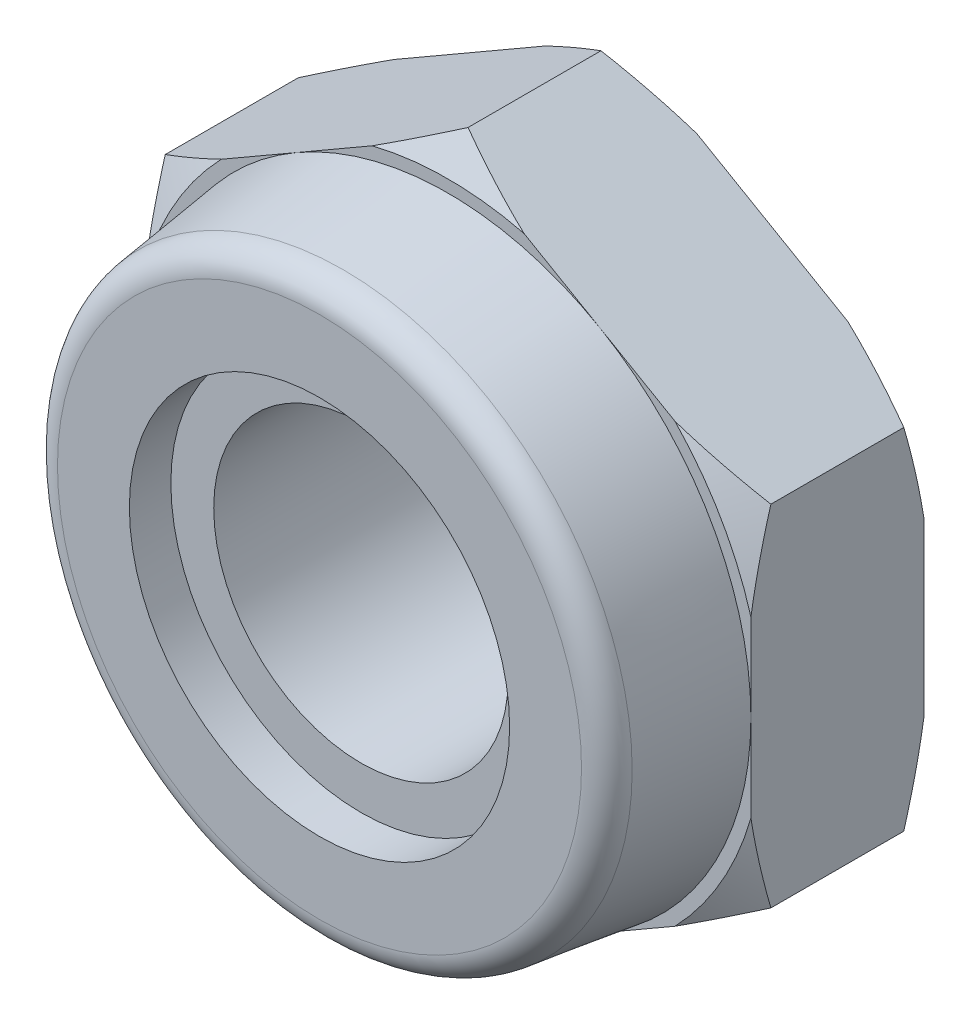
ISO-10303-21;
HEADER;
FILE_DESCRIPTION(('STEP AP214'),'2;1');
FILE_NAME('part.step','',(''),(''),'','','');
FILE_SCHEMA(('AUTOMOTIVE_DESIGN { 1 0 10303 214 1 1 1 1 }'));
ENDSEC;
DATA;
#1=APPLICATION_CONTEXT('core data for automotive mechanical design processes');
#2=APPLICATION_PROTOCOL_DEFINITION('international standard','automotive_design',2000,#1);
#3=PRODUCT_CONTEXT('',#1,'mechanical');
#4=PRODUCT('Part','Part','',(#3));
#5=PRODUCT_RELATED_PRODUCT_CATEGORY('part','',(#4));
#6=PRODUCT_DEFINITION_FORMATION('','',#4);
#7=PRODUCT_DEFINITION_CONTEXT('part definition',#1,'design');
#8=PRODUCT_DEFINITION('design','',#6,#7);
#9=PRODUCT_DEFINITION_SHAPE('','',#8);
#10=(LENGTH_UNIT() NAMED_UNIT(*) SI_UNIT(.MILLI.,.METRE.));
#11=(NAMED_UNIT(*) PLANE_ANGLE_UNIT() SI_UNIT($,.RADIAN.));
#12=(NAMED_UNIT(*) SI_UNIT($,.STERADIAN.) SOLID_ANGLE_UNIT());
#13=UNCERTAINTY_MEASURE_WITH_UNIT(LENGTH_MEASURE(1.E-05),#10,'distance_accuracy_value','');
#14=(GEOMETRIC_REPRESENTATION_CONTEXT(3) GLOBAL_UNCERTAINTY_ASSIGNED_CONTEXT((#13)) GLOBAL_UNIT_ASSIGNED_CONTEXT((#10,
#11,#12)) REPRESENTATION_CONTEXT('',''));
#15=CARTESIAN_POINT('',(0.,0.,0.));
#16=DIRECTION('',(0.,0.,1.));
#17=DIRECTION('',(1.,0.,0.));
#18=AXIS2_PLACEMENT_3D('',#15,#16,#17);
#19=CARTESIAN_POINT('',(-5.5626,-9.63470582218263,0.));
#20=DIRECTION('',(0.,0.,-1.));
#21=DIRECTION('',(-1.,0.,0.));
#22=AXIS2_PLACEMENT_3D('',#19,#20,#21);
#23=PLANE('',#22);
#24=CARTESIAN_POINT('',(0.,0.,0.));
#25=DIRECTION('',(0.,0.,1.));
#26=DIRECTION('',(1.,0.,0.));
#27=AXIS2_PLACEMENT_3D('',#24,#25,#26);
#28=CIRCLE('',#27,5.78813721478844);
#29=CARTESIAN_POINT('',(5.56259999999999,1.60000426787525,0.));
#30=VERTEX_POINT('',#29);
#31=CARTESIAN_POINT('',(4.16694434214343,4.01735077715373,0.));
#32=VERTEX_POINT('',#31);
#33=EDGE_CURVE('E195',#30,#32,#28,.T.);
#34=ORIENTED_EDGE('',*,*,#33,.T.);
#35=DIRECTION('',(-0.866025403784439,0.5,0.));
#36=VECTOR('',#35,1.);
#37=CARTESIAN_POINT('',(5.56259999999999,3.21156860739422,0.));
#38=LINE('',#37,#36);
#39=CARTESIAN_POINT('',(2.7813,4.81735291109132,0.));
#40=VERTEX_POINT('',#39);
#41=EDGE_CURVE('E209',#32,#40,#38,.T.);
#42=ORIENTED_EDGE('',*,*,#41,.T.);
#43=CARTESIAN_POINT('',(0.,0.,0.));
#44=DIRECTION('',(0.,0.,1.));
#45=DIRECTION('',(1.,0.,0.));
#46=AXIS2_PLACEMENT_3D('',#43,#44,#45);
#47=CIRCLE('',#46,5.56260000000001);
#48=CARTESIAN_POINT('',(5.56260000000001,0.,0.));
#49=VERTEX_POINT('',#48);
#50=EDGE_CURVE('E234',#49,#40,#47,.T.);
#51=ORIENTED_EDGE('',*,*,#50,.F.);
#52=DIRECTION('',(0.,1.,0.));
#53=VECTOR('',#52,1.);
#54=CARTESIAN_POINT('',(5.56259999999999,-3.21156860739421,0.));
#55=LINE('',#54,#53);
#56=EDGE_CURVE('E279',#49,#30,#55,.T.);
#57=ORIENTED_EDGE('',*,*,#56,.T.);
#58=EDGE_LOOP('',(#34,#42,#51,#57));
#59=FACE_BOUND('',#58,.T.);
#60=ADVANCED_FACE('F44',(#59),#23,.F.);
#61=CARTESIAN_POINT('',(1.39565565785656,5.61735504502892,0.));
#62=VERTEX_POINT('',#61);
#63=CARTESIAN_POINT('',(-1.39565565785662,5.6173550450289,0.));
#64=VERTEX_POINT('',#63);
#65=EDGE_CURVE('E478',#62,#64,#28,.T.);
#66=ORIENTED_EDGE('',*,*,#65,.T.);
#67=DIRECTION('',(-0.866025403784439,-0.5,0.));
#68=VECTOR('',#67,1.);
#69=CARTESIAN_POINT('',(0.,6.42313721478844,0.));
#70=LINE('',#69,#68);
#71=CARTESIAN_POINT('',(-2.78130000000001,4.81735291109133,0.));
#72=VERTEX_POINT('',#71);
#73=EDGE_CURVE('E290',#64,#72,#70,.T.);
#74=ORIENTED_EDGE('',*,*,#73,.T.);
#75=EDGE_CURVE('E227',#40,#72,#47,.T.);
#76=ORIENTED_EDGE('',*,*,#75,.F.);
#77=EDGE_CURVE('E281',#40,#62,#38,.T.);
#78=ORIENTED_EDGE('',*,*,#77,.T.);
#79=EDGE_LOOP('',(#66,#74,#76,#78));
#80=FACE_BOUND('',#79,.T.);
#81=ADVANCED_FACE('F419',(#80),#23,.F.);
#82=CARTESIAN_POINT('',(-4.16694434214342,4.01735077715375,0.));
#83=VERTEX_POINT('',#82);
#84=CARTESIAN_POINT('',(-5.56260000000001,1.60000426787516,0.));
#85=VERTEX_POINT('',#84);
#86=EDGE_CURVE('E481',#83,#85,#28,.T.);
#87=ORIENTED_EDGE('',*,*,#86,.T.);
#88=DIRECTION('',(0.,-1.,0.));
#89=VECTOR('',#88,1.);
#90=CARTESIAN_POINT('',(-5.56260000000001,3.21156860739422,0.));
#91=LINE('',#90,#89);
#92=CARTESIAN_POINT('',(-5.56260000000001,0.,0.));
#93=VERTEX_POINT('',#92);
#94=EDGE_CURVE('E288',#85,#93,#91,.T.);
#95=ORIENTED_EDGE('',*,*,#94,.T.);
#96=EDGE_CURVE('E235',#72,#93,#47,.T.);
#97=ORIENTED_EDGE('',*,*,#96,.F.);
#98=EDGE_CURVE('E287',#72,#83,#70,.T.);
#99=ORIENTED_EDGE('',*,*,#98,.T.);
#100=EDGE_LOOP('',(#87,#95,#97,#99));
#101=FACE_BOUND('',#100,.T.);
#102=ADVANCED_FACE('F475',(#101),#23,.F.);
#103=CARTESIAN_POINT('',(-5.56260000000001,-1.60000426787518,0.));
#104=VERTEX_POINT('',#103);
#105=CARTESIAN_POINT('',(-4.16694434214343,-4.01735077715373,0.));
#106=VERTEX_POINT('',#105);
#107=EDGE_CURVE('E66',#104,#106,#28,.T.);
#108=ORIENTED_EDGE('',*,*,#107,.T.);
#109=DIRECTION('',(0.866025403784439,-0.5,0.));
#110=VECTOR('',#109,1.);
#111=CARTESIAN_POINT('',(-5.56260000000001,-3.21156860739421,0.));
#112=LINE('',#111,#110);
#113=CARTESIAN_POINT('',(-2.7813,-4.81735291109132,0.));
#114=VERTEX_POINT('',#113);
#115=EDGE_CURVE('E270',#106,#114,#112,.T.);
#116=ORIENTED_EDGE('',*,*,#115,.T.);
#117=EDGE_CURVE('E469',#93,#114,#47,.T.);
#118=ORIENTED_EDGE('',*,*,#117,.F.);
#119=EDGE_CURVE('E286',#93,#104,#91,.T.);
#120=ORIENTED_EDGE('',*,*,#119,.T.);
#121=EDGE_LOOP('',(#108,#116,#118,#120));
#122=FACE_BOUND('',#121,.T.);
#123=ADVANCED_FACE('F622',(#122),#23,.F.);
#124=CARTESIAN_POINT('',(-1.39565565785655,-5.61735504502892,0.));
#125=VERTEX_POINT('',#124);
#126=CARTESIAN_POINT('',(1.39565565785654,-5.61735504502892,0.));
#127=VERTEX_POINT('',#126);
#128=EDGE_CURVE('E62',#125,#127,#28,.T.);
#129=ORIENTED_EDGE('',*,*,#128,.T.);
#130=DIRECTION('',(0.866025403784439,0.5,0.));
#131=VECTOR('',#130,1.);
#132=CARTESIAN_POINT('',(0.,-6.42313721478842,0.));
#133=LINE('',#132,#131);
#134=CARTESIAN_POINT('',(2.7813,-4.81735291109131,0.));
#135=VERTEX_POINT('',#134);
#136=EDGE_CURVE('E277',#127,#135,#133,.T.);
#137=ORIENTED_EDGE('',*,*,#136,.T.);
#138=EDGE_CURVE('E467',#114,#135,#47,.T.);
#139=ORIENTED_EDGE('',*,*,#138,.F.);
#140=EDGE_CURVE('E294',#114,#125,#112,.T.);
#141=ORIENTED_EDGE('',*,*,#140,.T.);
#142=EDGE_LOOP('',(#129,#137,#139,#141));
#143=FACE_BOUND('',#142,.T.);
#144=ADVANCED_FACE('F631',(#143),#23,.F.);
#145=CARTESIAN_POINT('',(0.,-6.42313721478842,-3.175));
#146=DIRECTION('',(0.5,-0.866025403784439,0.));
#147=DIRECTION('',(0.866025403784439,0.5,0.));
#148=AXIS2_PLACEMENT_3D('',#145,#146,#147);
#149=PLANE('',#148);
#150=DIRECTION('',(0.,0.,1.));
#151=VECTOR('',#150,1.);
#152=CARTESIAN_POINT('',(5.56259999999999,-3.21156860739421,-3.175));
#153=LINE('',#152,#151);
#154=CARTESIAN_POINT('',(5.56259999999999,-3.21156860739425,-2.80838257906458));
#155=VERTEX_POINT('',#154);
#156=CARTESIAN_POINT('',(5.56259999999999,-3.21156860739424,-0.366617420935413));
#157=VERTEX_POINT('',#156);
#158=EDGE_CURVE('E217',#155,#157,#153,.T.);
#159=ORIENTED_EDGE('',*,*,#158,.T.);
#160=CARTESIAN_POINT('',(9.42295491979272,-0.982791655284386,-2.12807296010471));
#161=CARTESIAN_POINT('',(9.24819544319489,-1.08368908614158,-2.03378314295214));
#162=CARTESIAN_POINT('',(9.07301757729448,-1.18482807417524,-1.94051140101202));
#163=CARTESIAN_POINT('',(8.72164863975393,-1.38769102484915,-1.75648219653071));
#164=CARTESIAN_POINT('',(8.54545744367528,-1.48941505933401,-1.66572505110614));
#165=CARTESIAN_POINT('',(8.19136127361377,-1.69385257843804,-1.48694033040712));
#166=CARTESIAN_POINT('',(8.01345261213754,-1.7965681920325,-1.39892246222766));
#167=CARTESIAN_POINT('',(7.65630184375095,-2.00276928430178,-1.22657910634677));
#168=CARTESIAN_POINT('',(7.47705977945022,-2.10625473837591,-1.14225350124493));
#169=CARTESIAN_POINT('',(7.1124587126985,-2.31675726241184,-0.976019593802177));
#170=CARTESIAN_POINT('',(6.92705994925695,-2.42379728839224,-0.894227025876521));
#171=CARTESIAN_POINT('',(6.55439179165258,-2.63895734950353,-0.736473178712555));
#172=CARTESIAN_POINT('',(6.36712230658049,-2.7470774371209,-0.660512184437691));
#173=CARTESIAN_POINT('',(5.99066950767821,-2.96442256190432,-0.515868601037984));
#174=CARTESIAN_POINT('',(5.80148823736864,-3.07364641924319,-0.447178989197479));
#175=CARTESIAN_POINT('',(5.42090459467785,-3.29337648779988,-0.318664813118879));
#176=CARTESIAN_POINT('',(5.22950251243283,-3.4038825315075,-0.258839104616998));
#177=CARTESIAN_POINT('',(4.77173397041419,-3.6681753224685,-0.129442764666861));
#178=CARTESIAN_POINT('',(4.50430080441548,-3.8225779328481,-0.0646967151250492));
#179=CARTESIAN_POINT('',(4.10041076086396,-4.05576395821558,0.0130990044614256));
#180=CARTESIAN_POINT('',(3.96532631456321,-4.13375499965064,0.0358101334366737));
#181=CARTESIAN_POINT('',(3.69441769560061,-4.29016416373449,0.0742198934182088));
#182=CARTESIAN_POINT('',(3.55859362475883,-4.36858222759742,0.0899194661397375));
#183=CARTESIAN_POINT('',(3.28802057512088,-4.52479765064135,0.113719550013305));
#184=CARTESIAN_POINT('',(3.15327727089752,-4.60259173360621,0.121905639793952));
#185=CARTESIAN_POINT('',(2.88360480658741,-4.75828720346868,0.13074460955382));
#186=CARTESIAN_POINT('',(2.74867564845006,-4.83618858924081,0.131397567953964));
#187=CARTESIAN_POINT('',(2.47894976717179,-4.99191489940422,0.125149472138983));
#188=CARTESIAN_POINT('',(2.3441530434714,-5.06973982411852,0.118248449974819));
#189=CARTESIAN_POINT('',(2.07497866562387,-5.22514772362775,0.0971012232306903));
#190=CARTESIAN_POINT('',(1.94060107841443,-5.30273065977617,0.0828539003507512));
#191=CARTESIAN_POINT('',(1.6230947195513,-5.48604304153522,0.0408724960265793));
#192=CARTESIAN_POINT('',(1.44026472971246,-5.59159998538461,0.0101022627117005));
#193=CARTESIAN_POINT('',(1.07635581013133,-5.80170289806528,-0.0630230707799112));
#194=CARTESIAN_POINT('',(0.895277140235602,-5.90624871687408,-0.105379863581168));
#195=CARTESIAN_POINT('',(0.534892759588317,-6.11431673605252,-0.200079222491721));
#196=CARTESIAN_POINT('',(0.35558929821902,-6.21783763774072,-0.252433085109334));
#197=CARTESIAN_POINT('',(-0.00100447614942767,-6.42371714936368,-0.365477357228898));
#198=CARTESIAN_POINT('',(-0.178294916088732,-6.52607583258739,-0.426167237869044));
#199=CARTESIAN_POINT('',(-0.533083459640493,-6.73091309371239,-0.555205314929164));
#200=CARTESIAN_POINT('',(-0.710558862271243,-6.83337856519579,-0.623636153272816));
#201=CARTESIAN_POINT('',(-1.06362951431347,-7.03722400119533,-0.766239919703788));
#202=CARTESIAN_POINT('',(-1.23922592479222,-7.13860463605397,-0.84040903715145));
#203=CARTESIAN_POINT('',(-1.58881849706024,-7.34044200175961,-0.993471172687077));
#204=CARTESIAN_POINT('',(-1.76281498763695,-7.44089892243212,-1.07236319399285));
#205=CARTESIAN_POINT('',(-2.10944403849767,-7.64102529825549,-1.23404436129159));
#206=CARTESIAN_POINT('',(-2.28207657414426,-7.74069473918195,-1.31683357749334));
#207=CARTESIAN_POINT('',(-2.57291488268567,-7.90861031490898,-1.45951571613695));
#208=CARTESIAN_POINT('',(-2.69143196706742,-7.97703618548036,-1.51856612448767));
#209=CARTESIAN_POINT('',(-2.92794924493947,-8.11358949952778,-1.63801912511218));
#210=CARTESIAN_POINT('',(-3.04594945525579,-8.18171695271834,-1.69842167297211));
#211=CARTESIAN_POINT('',(-3.28024937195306,-8.31699007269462,-1.81977975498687));
#212=CARTESIAN_POINT('',(-3.39655392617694,-8.38413853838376,-1.88072282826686));
#213=CARTESIAN_POINT('',(-3.62875242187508,-8.5181984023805,-2.00364973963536));
#214=CARTESIAN_POINT('',(-3.74464635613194,-8.58510979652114,-2.06563359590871));
#215=CARTESIAN_POINT('',(-3.86035491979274,-8.65191416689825,-2.12807296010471));
#216=B_SPLINE_CURVE_WITH_KNOTS('',3,(#160,#161,#162,#163,#164,#165,#166,#167,#168,#169,#170,
#171,#172,#173,#174,#175,#176,#177,#178,#179,#180,#181,#182,#183,#184,#185,#186,#187,#188,#189,
#190,#191,#192,#193,#194,#195,#196,#197,#198,#199,#200,#201,#202,#203,#204,#205,#206,#207,#208,
#209,#210,#211,#212,#213,#214,#215),.UNSPECIFIED.,.F.,.F.,(4,2,2,2,2,2,2,2,2,2,2,2,2,2,2,2,2,2,
2,2,2,2,2,2,2,2,2,4),(0.,0.668217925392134,1.33651973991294,2.00696882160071,2.67739656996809,
3.36484632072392,4.05232964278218,4.73914281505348,5.42586724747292,6.37139841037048,
6.8441481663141,7.31683440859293,7.78406740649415,8.25129554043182,8.71852169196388,
9.18581898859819,9.82546536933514,10.4652052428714,11.1056723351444,11.7460988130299,
12.3941569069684,13.0417882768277,13.6892834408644,14.3367902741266,14.7839276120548,
15.231050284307,15.6734793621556,16.1159161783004),.UNSPECIFIED.);
#217=CARTESIAN_POINT('',(4.16694434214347,-4.01735077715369,0.));
#218=VERTEX_POINT('',#217);
#219=EDGE_CURVE('E200',#157,#218,#216,.T.);
#220=ORIENTED_EDGE('',*,*,#219,.T.);
#221=EDGE_CURVE('E282',#135,#218,#133,.T.);
#222=ORIENTED_EDGE('',*,*,#221,.F.);
#223=ORIENTED_EDGE('',*,*,#136,.F.);
#224=CARTESIAN_POINT('',(0.,-6.42313721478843,-0.366617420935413));
#225=VERTEX_POINT('',#224);
#226=EDGE_CURVE('E530',#127,#225,#216,.T.);
#227=ORIENTED_EDGE('',*,*,#226,.T.);
#228=DIRECTION('',(0.,0.,1.));
#229=VECTOR('',#228,1.);
#230=CARTESIAN_POINT('',(0.,-6.42313721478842,-3.175));
#231=LINE('',#230,#229);
#232=CARTESIAN_POINT('',(0.,-6.42313721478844,-2.80838257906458));
#233=VERTEX_POINT('',#232);
#234=EDGE_CURVE('E291',#233,#225,#231,.T.);
#235=ORIENTED_EDGE('',*,*,#234,.F.);
#236=CARTESIAN_POINT('',(9.42295491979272,-0.982791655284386,-1.04692703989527));
#237=CARTESIAN_POINT('',(9.2481954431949,-1.08368908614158,-1.14121685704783));
#238=CARTESIAN_POINT('',(9.07301757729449,-1.18482807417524,-1.23448859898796));
#239=CARTESIAN_POINT('',(8.72164863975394,-1.38769102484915,-1.41851780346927));
#240=CARTESIAN_POINT('',(8.54545744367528,-1.489415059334,-1.50927494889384));
#241=CARTESIAN_POINT('',(8.19136127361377,-1.69385257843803,-1.68805966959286));
#242=CARTESIAN_POINT('',(8.01345261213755,-1.79656819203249,-1.77607753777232));
#243=CARTESIAN_POINT('',(7.65630184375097,-2.00276928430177,-1.94842089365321));
#244=CARTESIAN_POINT('',(7.47705977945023,-2.1062547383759,-2.03274649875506));
#245=CARTESIAN_POINT('',(7.11245871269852,-2.31675726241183,-2.19898040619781));
#246=CARTESIAN_POINT('',(6.92705994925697,-2.42379728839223,-2.28077297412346));
#247=CARTESIAN_POINT('',(6.55439179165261,-2.63895734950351,-2.43852682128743));
#248=CARTESIAN_POINT('',(6.36712230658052,-2.74707743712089,-2.51448781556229));
#249=CARTESIAN_POINT('',(5.99066950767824,-2.96442256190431,-2.659131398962));
#250=CARTESIAN_POINT('',(5.80148823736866,-3.07364641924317,-2.72782101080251));
#251=CARTESIAN_POINT('',(5.42090459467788,-3.29337648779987,-2.85633518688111));
#252=CARTESIAN_POINT('',(5.22950251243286,-3.40388253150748,-2.91616089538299));
#253=CARTESIAN_POINT('',(4.77173397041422,-3.66817532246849,-3.04555723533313));
#254=CARTESIAN_POINT('',(4.50430080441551,-3.82257793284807,-3.11030328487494));
#255=CARTESIAN_POINT('',(4.100410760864,-4.05576395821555,-3.18809900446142));
#256=CARTESIAN_POINT('',(3.96532631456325,-4.13375499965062,-3.21081013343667));
#257=CARTESIAN_POINT('',(3.69441769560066,-4.29016416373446,-3.2492198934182));
#258=CARTESIAN_POINT('',(3.55859362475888,-4.36858222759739,-3.26491946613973));
#259=CARTESIAN_POINT('',(3.28802057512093,-4.52479765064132,-3.2887195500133));
#260=CARTESIAN_POINT('',(3.15327727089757,-4.60259173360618,-3.29690563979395));
#261=CARTESIAN_POINT('',(2.88360480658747,-4.75828720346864,-3.30574460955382));
#262=CARTESIAN_POINT('',(2.74867564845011,-4.83618858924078,-3.30639756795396));
#263=CARTESIAN_POINT('',(2.47894976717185,-4.99191489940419,-3.30014947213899));
#264=CARTESIAN_POINT('',(2.34415304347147,-5.06973982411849,-3.29324844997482));
#265=CARTESIAN_POINT('',(2.07497866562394,-5.22514772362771,-3.2721012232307));
#266=CARTESIAN_POINT('',(1.9406010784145,-5.30273065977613,-3.25785390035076));
#267=CARTESIAN_POINT('',(1.62309471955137,-5.48604304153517,-3.21587249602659));
#268=CARTESIAN_POINT('',(1.44026472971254,-5.59159998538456,-3.18510226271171));
#269=CARTESIAN_POINT('',(1.07635581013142,-5.80170289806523,-3.11197692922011));
#270=CARTESIAN_POINT('',(0.895277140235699,-5.90624871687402,-3.06962013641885));
#271=CARTESIAN_POINT('',(0.534892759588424,-6.11431673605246,-2.97492077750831));
#272=CARTESIAN_POINT('',(0.355589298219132,-6.21783763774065,-2.9225669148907));
#273=CARTESIAN_POINT('',(-0.00100447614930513,-6.42371714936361,-2.80952264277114));
#274=CARTESIAN_POINT('',(-0.178294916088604,-6.52607583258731,-2.748832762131));
#275=CARTESIAN_POINT('',(-0.533083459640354,-6.73091309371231,-2.61979468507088));
#276=CARTESIAN_POINT('',(-0.710558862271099,-6.83337856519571,-2.55136384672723));
#277=CARTESIAN_POINT('',(-1.06362951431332,-7.03722400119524,-2.40876008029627));
#278=CARTESIAN_POINT('',(-1.23922592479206,-7.13860463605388,-2.33459096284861));
#279=CARTESIAN_POINT('',(-1.58881849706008,-7.34044200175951,-2.18152882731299));
#280=CARTESIAN_POINT('',(-1.76281498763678,-7.44089892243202,-2.10263680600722));
#281=CARTESIAN_POINT('',(-2.10944403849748,-7.64102529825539,-1.94095563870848));
#282=CARTESIAN_POINT('',(-2.28207657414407,-7.74069473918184,-1.85816642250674));
#283=CARTESIAN_POINT('',(-2.57291488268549,-7.90861031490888,-1.71548428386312));
#284=CARTESIAN_POINT('',(-2.69143196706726,-7.97703618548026,-1.65643387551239));
#285=CARTESIAN_POINT('',(-2.92794924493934,-8.11358949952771,-1.53698087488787));
#286=CARTESIAN_POINT('',(-3.04594945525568,-8.18171695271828,-1.47657832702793));
#287=CARTESIAN_POINT('',(-3.28024937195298,-8.31699007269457,-1.35522024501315));
#288=CARTESIAN_POINT('',(-3.39655392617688,-8.38413853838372,-1.29427717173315));
#289=CARTESIAN_POINT('',(-3.62875242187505,-8.51819840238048,-1.17135026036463));
#290=CARTESIAN_POINT('',(-3.74464635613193,-8.58510979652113,-1.10936640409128));
#291=CARTESIAN_POINT('',(-3.86035491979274,-8.65191416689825,-1.04692703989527));
#292=B_SPLINE_CURVE_WITH_KNOTS('',3,(#236,#237,#238,#239,#240,#241,#242,#243,#244,#245,#246,
#247,#248,#249,#250,#251,#252,#253,#254,#255,#256,#257,#258,#259,#260,#261,#262,#263,#264,#265,
#266,#267,#268,#269,#270,#271,#272,#273,#274,#275,#276,#277,#278,#279,#280,#281,#282,#283,#284,
#285,#286,#287,#288,#289,#290,#291),.UNSPECIFIED.,.F.,.F.,(4,2,2,2,2,2,2,2,2,2,2,2,2,2,2,2,2,2,
2,2,2,2,2,2,2,2,2,4),(0.,0.66821792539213,1.33651973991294,2.0069688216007,2.67739656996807,
3.3648463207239,4.05232964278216,4.73914281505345,5.4258672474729,6.37139841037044,
6.84414816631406,7.31683440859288,7.7840674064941,8.25129554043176,8.71852169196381,
9.18581898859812,9.82546536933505,10.4652052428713,11.1056723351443,11.7460988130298,
12.3941569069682,13.0417882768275,13.6892834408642,14.3367902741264,14.7839276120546,
15.2310502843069,15.6734793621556,16.1159161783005),.UNSPECIFIED.);
#293=CARTESIAN_POINT('',(1.39565565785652,-5.61735504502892,-3.175));
#294=VERTEX_POINT('',#293);
#295=EDGE_CURVE('E461',#294,#233,#292,.T.);
#296=ORIENTED_EDGE('',*,*,#295,.F.);
#297=DIRECTION('',(0.866025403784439,0.5,0.));
#298=VECTOR('',#297,1.);
#299=CARTESIAN_POINT('',(0.,-6.42313721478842,-3.175));
#300=LINE('',#299,#298);
#301=CARTESIAN_POINT('',(4.16694434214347,-4.0173507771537,-3.175));
#302=VERTEX_POINT('',#301);
#303=EDGE_CURVE('E265',#294,#302,#300,.T.);
#304=ORIENTED_EDGE('',*,*,#303,.T.);
#305=EDGE_CURVE('E250',#155,#302,#292,.T.);
#306=ORIENTED_EDGE('',*,*,#305,.F.);
#307=EDGE_LOOP('',(#159,#220,#222,#223,#227,#235,#296,#304,#306));
#308=FACE_BOUND('',#307,.T.);
#309=ADVANCED_FACE('F50',(#308),#149,.T.);
#310=CARTESIAN_POINT('',(-5.56260000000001,-3.21156860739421,-3.175));
#311=DIRECTION('',(-0.5,-0.866025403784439,0.));
#312=DIRECTION('',(0.866025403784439,-0.5,0.));
#313=AXIS2_PLACEMENT_3D('',#310,#311,#312);
#314=PLANE('',#313);
#315=ORIENTED_EDGE('',*,*,#234,.T.);
#316=CARTESIAN_POINT('',(3.86035491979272,-8.65191416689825,-2.12807296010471));
#317=CARTESIAN_POINT('',(3.6855954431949,-8.55101673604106,-2.03378314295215));
#318=CARTESIAN_POINT('',(3.51041757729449,-8.44987774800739,-1.94051140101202));
#319=CARTESIAN_POINT('',(3.15904863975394,-8.24701479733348,-1.75648219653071));
#320=CARTESIAN_POINT('',(2.98285744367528,-8.14529076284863,-1.66572505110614));
#321=CARTESIAN_POINT('',(2.62876127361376,-7.94085324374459,-1.48694033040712));
#322=CARTESIAN_POINT('',(2.45085261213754,-7.83813763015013,-1.39892246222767));
#323=CARTESIAN_POINT('',(2.09370184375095,-7.63193653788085,-1.22657910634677));
#324=CARTESIAN_POINT('',(1.91445977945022,-7.52845108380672,-1.14225350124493));
#325=CARTESIAN_POINT('',(1.5498587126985,-7.31794855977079,-0.976019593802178));
#326=CARTESIAN_POINT('',(1.36445994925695,-7.21090853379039,-0.894227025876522));
#327=CARTESIAN_POINT('',(0.991791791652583,-6.99574847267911,-0.736473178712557));
#328=CARTESIAN_POINT('',(0.804522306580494,-6.88762838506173,-0.660512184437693));
#329=CARTESIAN_POINT('',(0.428069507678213,-6.67028326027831,-0.515868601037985));
#330=CARTESIAN_POINT('',(0.238888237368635,-6.56105940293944,-0.447178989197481));
#331=CARTESIAN_POINT('',(-0.14169540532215,-6.34132933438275,-0.31866481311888));
#332=CARTESIAN_POINT('',(-0.333097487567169,-6.23082329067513,-0.258839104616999));
#333=CARTESIAN_POINT('',(-0.790866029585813,-5.96653049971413,-0.129442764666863));
#334=CARTESIAN_POINT('',(-1.05829919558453,-5.81212788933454,-0.0646967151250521));
#335=CARTESIAN_POINT('',(-1.46218923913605,-5.57894186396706,0.0130990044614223));
#336=CARTESIAN_POINT('',(-1.5972736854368,-5.50095082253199,0.0358101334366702));
#337=CARTESIAN_POINT('',(-1.86818230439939,-5.34454165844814,0.0742198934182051));
#338=CARTESIAN_POINT('',(-2.00400637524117,-5.26612359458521,0.0899194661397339));
#339=CARTESIAN_POINT('',(-2.27457942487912,-5.10990817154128,0.113719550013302));
#340=CARTESIAN_POINT('',(-2.40932272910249,-5.03211408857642,0.121905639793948));
#341=CARTESIAN_POINT('',(-2.67899519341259,-4.87641861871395,0.130744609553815));
#342=CARTESIAN_POINT('',(-2.81392435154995,-4.79851723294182,0.13139756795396));
#343=CARTESIAN_POINT('',(-3.08365023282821,-4.64279092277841,0.125149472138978));
#344=CARTESIAN_POINT('',(-3.2184469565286,-4.56496599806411,0.118248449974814));
#345=CARTESIAN_POINT('',(-3.48762133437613,-4.40955809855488,0.0971012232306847));
#346=CARTESIAN_POINT('',(-3.62199892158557,-4.33197516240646,0.0828539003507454));
#347=CARTESIAN_POINT('',(-3.93950528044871,-4.14866278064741,0.0408724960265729));
#348=CARTESIAN_POINT('',(-4.12233527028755,-4.04310583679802,0.010102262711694));
#349=CARTESIAN_POINT('',(-4.48624418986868,-3.83300292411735,-0.0630230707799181));
#350=CARTESIAN_POINT('',(-4.66732285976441,-3.72845710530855,-0.105379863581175));
#351=CARTESIAN_POINT('',(-5.02770724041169,-3.52038908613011,-0.200079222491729));
#352=CARTESIAN_POINT('',(-5.20701070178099,-3.41686818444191,-0.252433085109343));
#353=CARTESIAN_POINT('',(-5.56360447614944,-3.21098867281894,-0.365477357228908));
#354=CARTESIAN_POINT('',(-5.74089491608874,-3.10862998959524,-0.426167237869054));
#355=CARTESIAN_POINT('',(-6.09568345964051,-2.90379272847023,-0.555205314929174));
#356=CARTESIAN_POINT('',(-6.27315886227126,-2.80132725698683,-0.623636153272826));
#357=CARTESIAN_POINT('',(-6.62622951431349,-2.59748182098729,-0.7662399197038));
#358=CARTESIAN_POINT('',(-6.80182592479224,-2.49610118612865,-0.840409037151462));
#359=CARTESIAN_POINT('',(-7.15141849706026,-2.29426382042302,-0.993471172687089));
#360=CARTESIAN_POINT('',(-7.32541498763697,-2.1938068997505,-1.07236319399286));
#361=CARTESIAN_POINT('',(-7.67204403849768,-1.99368052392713,-1.23404436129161));
#362=CARTESIAN_POINT('',(-7.84467657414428,-1.89401108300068,-1.31683357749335));
#363=CARTESIAN_POINT('',(-8.13551488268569,-1.72609550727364,-1.45951571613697));
#364=CARTESIAN_POINT('',(-8.25403196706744,-1.65766963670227,-1.51856612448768));
#365=CARTESIAN_POINT('',(-8.49054924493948,-1.52111632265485,-1.63801912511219));
#366=CARTESIAN_POINT('',(-8.6085494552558,-1.45298886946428,-1.69842167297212));
#367=CARTESIAN_POINT('',(-8.84284937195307,-1.31771574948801,-1.81977975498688));
#368=CARTESIAN_POINT('',(-8.95915392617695,-1.25056728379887,-1.88072282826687));
#369=CARTESIAN_POINT('',(-9.19135242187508,-1.11650741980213,-2.00364973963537));
#370=CARTESIAN_POINT('',(-9.30724635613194,-1.04959602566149,-2.06563359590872));
#371=CARTESIAN_POINT('',(-9.42295491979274,-0.982791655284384,-2.12807296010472));
#372=B_SPLINE_CURVE_WITH_KNOTS('',3,(#316,#317,#318,#319,#320,#321,#322,#323,#324,#325,#326,
#327,#328,#329,#330,#331,#332,#333,#334,#335,#336,#337,#338,#339,#340,#341,#342,#343,#344,#345,
#346,#347,#348,#349,#350,#351,#352,#353,#354,#355,#356,#357,#358,#359,#360,#361,#362,#363,#364,
#365,#366,#367,#368,#369,#370,#371),.UNSPECIFIED.,.F.,.F.,(4,2,2,2,2,2,2,2,2,2,2,2,2,2,2,2,2,2,
2,2,2,2,2,2,2,2,2,4),(0.,0.668217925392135,1.33651973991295,2.00696882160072,2.67739656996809,
3.36484632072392,4.05232964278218,4.73914281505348,5.42586724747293,6.37139841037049,
6.84414816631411,7.31683440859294,7.78406740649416,8.25129554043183,8.71852169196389,
9.1858189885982,9.82546536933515,10.4652052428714,11.1056723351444,11.7460988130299,
12.3941569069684,13.0417882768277,13.6892834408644,14.3367902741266,14.7839276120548,
15.231050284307,15.6734793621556,16.1159161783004),.UNSPECIFIED.);
#373=EDGE_CURVE('E526',#225,#125,#372,.T.);
#374=ORIENTED_EDGE('',*,*,#373,.T.);
#375=ORIENTED_EDGE('',*,*,#140,.F.);
#376=ORIENTED_EDGE('',*,*,#115,.F.);
#377=CARTESIAN_POINT('',(-5.56260000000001,-3.21156860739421,-0.366617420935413));
#378=VERTEX_POINT('',#377);
#379=EDGE_CURVE('E321',#106,#378,#372,.T.);
#380=ORIENTED_EDGE('',*,*,#379,.T.);
#381=DIRECTION('',(0.,0.,1.));
#382=VECTOR('',#381,1.);
#383=CARTESIAN_POINT('',(-5.56260000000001,-3.21156860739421,-3.175));
#384=LINE('',#383,#382);
#385=CARTESIAN_POINT('',(-5.56260000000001,-3.21156860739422,-2.80838257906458));
#386=VERTEX_POINT('',#385);
#387=EDGE_CURVE('E300',#386,#378,#384,.T.);
#388=ORIENTED_EDGE('',*,*,#387,.F.);
#389=CARTESIAN_POINT('',(3.86035491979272,-8.65191416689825,-1.04692703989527));
#390=CARTESIAN_POINT('',(3.6855954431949,-8.55101673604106,-1.14121685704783));
#391=CARTESIAN_POINT('',(3.51041757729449,-8.44987774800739,-1.23448859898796));
#392=CARTESIAN_POINT('',(3.15904863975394,-8.24701479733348,-1.41851780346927));
#393=CARTESIAN_POINT('',(2.98285744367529,-8.14529076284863,-1.50927494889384));
#394=CARTESIAN_POINT('',(2.62876127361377,-7.9408532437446,-1.68805966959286));
#395=CARTESIAN_POINT('',(2.45085261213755,-7.83813763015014,-1.77607753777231));
#396=CARTESIAN_POINT('',(2.09370184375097,-7.63193653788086,-1.94842089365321));
#397=CARTESIAN_POINT('',(1.91445977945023,-7.52845108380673,-2.03274649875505));
#398=CARTESIAN_POINT('',(1.54985871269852,-7.3179485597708,-2.1989804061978));
#399=CARTESIAN_POINT('',(1.36445994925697,-7.2109085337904,-2.28077297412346));
#400=CARTESIAN_POINT('',(0.991791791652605,-6.99574847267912,-2.43852682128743));
#401=CARTESIAN_POINT('',(0.804522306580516,-6.88762838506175,-2.51448781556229));
#402=CARTESIAN_POINT('',(0.428069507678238,-6.67028326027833,-2.659131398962));
#403=CARTESIAN_POINT('',(0.238888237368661,-6.56105940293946,-2.7278210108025));
#404=CARTESIAN_POINT('',(-0.141695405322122,-6.34132933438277,-2.85633518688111));
#405=CARTESIAN_POINT('',(-0.33309748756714,-6.23082329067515,-2.91616089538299));
#406=CARTESIAN_POINT('',(-0.790866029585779,-5.96653049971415,-3.04555723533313));
#407=CARTESIAN_POINT('',(-1.05829919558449,-5.81212788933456,-3.11030328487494));
#408=CARTESIAN_POINT('',(-1.46218923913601,-5.57894186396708,-3.18809900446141));
#409=CARTESIAN_POINT('',(-1.59727368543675,-5.50095082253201,-3.21081013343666));
#410=CARTESIAN_POINT('',(-1.86818230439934,-5.34454165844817,-3.2492198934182));
#411=CARTESIAN_POINT('',(-2.00400637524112,-5.26612359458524,-3.26491946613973));
#412=CARTESIAN_POINT('',(-2.27457942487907,-5.10990817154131,-3.2887195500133));
#413=CARTESIAN_POINT('',(-2.40932272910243,-5.03211408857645,-3.29690563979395));
#414=CARTESIAN_POINT('',(-2.67899519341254,-4.87641861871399,-3.30574460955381));
#415=CARTESIAN_POINT('',(-2.81392435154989,-4.79851723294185,-3.30639756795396));
#416=CARTESIAN_POINT('',(-3.08365023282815,-4.64279092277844,-3.30014947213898));
#417=CARTESIAN_POINT('',(-3.21844695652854,-4.56496599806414,-3.29324844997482));
#418=CARTESIAN_POINT('',(-3.48762133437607,-4.40955809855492,-3.27210122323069));
#419=CARTESIAN_POINT('',(-3.62199892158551,-4.3319751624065,-3.25785390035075));
#420=CARTESIAN_POINT('',(-3.93950528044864,-4.14866278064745,-3.21587249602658));
#421=CARTESIAN_POINT('',(-4.12233527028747,-4.04310583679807,-3.18510226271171));
#422=CARTESIAN_POINT('',(-4.48624418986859,-3.8330029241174,-3.1119769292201));
#423=CARTESIAN_POINT('',(-4.66732285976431,-3.72845710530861,-3.06962013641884));
#424=CARTESIAN_POINT('',(-5.02770724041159,-3.52038908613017,-2.9749207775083));
#425=CARTESIAN_POINT('',(-5.20701070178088,-3.41686818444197,-2.92256691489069));
#426=CARTESIAN_POINT('',(-5.56360447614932,-3.21098867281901,-2.80952264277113));
#427=CARTESIAN_POINT('',(-5.74089491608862,-3.10862998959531,-2.74883276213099));
#428=CARTESIAN_POINT('',(-6.09568345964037,-2.90379272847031,-2.61979468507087));
#429=CARTESIAN_POINT('',(-6.27315886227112,-2.80132725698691,-2.55136384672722));
#430=CARTESIAN_POINT('',(-6.62622951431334,-2.59748182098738,-2.40876008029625));
#431=CARTESIAN_POINT('',(-6.80182592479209,-2.49610118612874,-2.33459096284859));
#432=CARTESIAN_POINT('',(-7.1514184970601,-2.29426382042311,-2.18152882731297));
#433=CARTESIAN_POINT('',(-7.3254149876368,-2.1938068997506,-2.10263680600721));
#434=CARTESIAN_POINT('',(-7.67204403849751,-1.99368052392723,-1.94095563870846));
#435=CARTESIAN_POINT('',(-7.8446765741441,-1.89401108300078,-1.85816642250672));
#436=CARTESIAN_POINT('',(-8.13551488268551,-1.72609550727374,-1.7154842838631));
#437=CARTESIAN_POINT('',(-8.25403196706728,-1.65766963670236,-1.65643387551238));
#438=CARTESIAN_POINT('',(-8.49054924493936,-1.52111632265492,-1.53698087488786));
#439=CARTESIAN_POINT('',(-8.60854945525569,-1.45298886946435,-1.47657832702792));
#440=CARTESIAN_POINT('',(-8.84284937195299,-1.31771574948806,-1.35522024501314));
#441=CARTESIAN_POINT('',(-8.95915392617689,-1.25056728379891,-1.29427717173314));
#442=CARTESIAN_POINT('',(-9.19135242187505,-1.11650741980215,-1.17135026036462));
#443=CARTESIAN_POINT('',(-9.30724635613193,-1.0495960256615,-1.10936640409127));
#444=CARTESIAN_POINT('',(-9.42295491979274,-0.982791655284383,-1.04692703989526));
#445=B_SPLINE_CURVE_WITH_KNOTS('',3,(#389,#390,#391,#392,#393,#394,#395,#396,#397,#398,#399,
#400,#401,#402,#403,#404,#405,#406,#407,#408,#409,#410,#411,#412,#413,#414,#415,#416,#417,#418,
#419,#420,#421,#422,#423,#424,#425,#426,#427,#428,#429,#430,#431,#432,#433,#434,#435,#436,#437,
#438,#439,#440,#441,#442,#443,#444),.UNSPECIFIED.,.F.,.F.,(4,2,2,2,2,2,2,2,2,2,2,2,2,2,2,2,2,2,
2,2,2,2,2,2,2,2,2,4),(0.,0.668217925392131,1.33651973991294,2.0069688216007,2.67739656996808,
3.3648463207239,4.05232964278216,4.73914281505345,5.4258672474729,6.37139841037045,
6.84414816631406,7.31683440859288,7.7840674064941,8.25129554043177,8.71852169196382,
9.18581898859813,9.82546536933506,10.4652052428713,11.1056723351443,11.7460988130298,
12.3941569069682,13.0417882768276,13.6892834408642,14.3367902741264,14.7839276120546,
15.2310502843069,15.6734793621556,16.1159161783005),.UNSPECIFIED.);
#446=CARTESIAN_POINT('',(-4.16694434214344,-4.01735077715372,-3.175));
#447=VERTEX_POINT('',#446);
#448=EDGE_CURVE('E403',#447,#386,#445,.T.);
#449=ORIENTED_EDGE('',*,*,#448,.F.);
#450=DIRECTION('',(0.866025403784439,-0.5,0.));
#451=VECTOR('',#450,1.);
#452=CARTESIAN_POINT('',(-5.56260000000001,-3.21156860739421,-3.175));
#453=LINE('',#452,#451);
#454=CARTESIAN_POINT('',(-1.39565565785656,-5.61735504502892,-3.175));
#455=VERTEX_POINT('',#454);
#456=EDGE_CURVE('E224',#447,#455,#453,.T.);
#457=ORIENTED_EDGE('',*,*,#456,.T.);
#458=EDGE_CURVE('E409',#233,#455,#445,.T.);
#459=ORIENTED_EDGE('',*,*,#458,.F.);
#460=EDGE_LOOP('',(#315,#374,#375,#376,#380,#388,#449,#457,#459));
#461=FACE_BOUND('',#460,.T.);
#462=ADVANCED_FACE('F415',(#461),#314,.T.);
#463=CARTESIAN_POINT('',(-5.56260000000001,3.21156860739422,-3.175));
#464=DIRECTION('',(-1.,0.,0.));
#465=DIRECTION('',(0.,-1.,0.));
#466=AXIS2_PLACEMENT_3D('',#463,#464,#465);
#467=PLANE('',#466);
#468=ORIENTED_EDGE('',*,*,#387,.T.);
#469=CARTESIAN_POINT('',(-5.56260000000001,-7.07192352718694,-1.85291411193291));
#470=CARTESIAN_POINT('',(-5.56260000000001,-6.87097025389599,-1.76174762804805));
#471=CARTESIAN_POINT('',(-5.56260000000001,-6.66946705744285,-1.67177020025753));
#472=CARTESIAN_POINT('',(-5.56260000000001,-6.26512525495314,-1.49477044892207));
#473=CARTESIAN_POINT('',(-5.56260000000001,-6.06228641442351,-1.40774866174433));
#474=CARTESIAN_POINT('',(-5.56260000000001,-5.65425901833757,-1.23691416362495));
#475=CARTESIAN_POINT('',(-5.56260000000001,-5.44906418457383,-1.15311638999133));
#476=CARTESIAN_POINT('',(-5.56260000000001,-5.03693928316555,-0.98991356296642));
#477=CARTESIAN_POINT('',(-5.56260000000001,-4.83000929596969,-0.91050830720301));
#478=CARTESIAN_POINT('',(-5.56260000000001,-4.41509364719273,-0.757413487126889));
#479=CARTESIAN_POINT('',(-5.56260000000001,-4.20711692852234,-0.683699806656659));
#480=CARTESIAN_POINT('',(-5.56260000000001,-3.78893999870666,-0.542791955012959));
#481=CARTESIAN_POINT('',(-5.56260000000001,-3.57873967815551,-0.475598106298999));
#482=CARTESIAN_POINT('',(-5.56260000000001,-3.1562260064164,-0.349272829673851));
#483=CARTESIAN_POINT('',(-5.56260000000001,-2.94391594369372,-0.290130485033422));
#484=CARTESIAN_POINT('',(-5.56260000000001,-2.51681893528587,-0.181481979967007));
#485=CARTESIAN_POINT('',(-5.56260000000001,-2.30203209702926,-0.131975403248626));
#486=CARTESIAN_POINT('',(-5.56260000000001,-1.93121852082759,-0.0568004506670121));
#487=CARTESIAN_POINT('',(-5.56260000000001,-1.7757555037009,-0.0283501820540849));
#488=CARTESIAN_POINT('',(-5.56260000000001,-1.4637887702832,0.0220044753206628));
#489=CARTESIAN_POINT('',(-5.56260000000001,-1.30728523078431,0.0439099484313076));
#490=CARTESIAN_POINT('',(-5.56260000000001,-0.993468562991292,0.0806018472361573));
#491=CARTESIAN_POINT('',(-5.56260000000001,-0.836155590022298,0.0953895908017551));
#492=CARTESIAN_POINT('',(-5.56260000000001,-0.5209975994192,0.117422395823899));
#493=CARTESIAN_POINT('',(-5.56260000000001,-0.36315258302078,0.124667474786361));
#494=CARTESIAN_POINT('',(-5.56260000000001,-0.0473755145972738,0.131388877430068));
#495=CARTESIAN_POINT('',(-5.56260000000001,0.110556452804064,0.13086913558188));
#496=CARTESIAN_POINT('',(-5.56260000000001,0.426201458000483,0.122087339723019));
#497=CARTESIAN_POINT('',(-5.56260000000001,0.583914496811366,0.113825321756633));
#498=CARTESIAN_POINT('',(-5.56260000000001,0.898771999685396,0.0898109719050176));
#499=CARTESIAN_POINT('',(-5.56260000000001,1.05591644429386,0.0740583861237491));
#500=CARTESIAN_POINT('',(-5.56260000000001,1.36935158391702,0.0355176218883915));
#501=CARTESIAN_POINT('',(-5.56260000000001,1.5256421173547,0.0127281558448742));
#502=CARTESIAN_POINT('',(-5.56260000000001,2.14801290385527,-0.0912516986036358));
#503=CARTESIAN_POINT('',(-5.56260000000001,2.60990723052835,-0.198231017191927));
#504=CARTESIAN_POINT('',(-5.56260000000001,3.29422291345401,-0.388910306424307));
#505=CARTESIAN_POINT('',(-5.56260000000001,3.5212027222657,-0.457616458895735));
#506=CARTESIAN_POINT('',(-5.56260000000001,3.97254729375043,-0.60320052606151));
#507=CARTESIAN_POINT('',(-5.56260000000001,4.19691223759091,-0.68007787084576));
#508=CARTESIAN_POINT('',(-5.56260000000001,4.64579679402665,-0.841306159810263));
#509=CARTESIAN_POINT('',(-5.56260000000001,4.87028905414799,-0.925732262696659));
#510=CARTESIAN_POINT('',(-5.56260000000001,5.31717982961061,-1.09998110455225));
#511=CARTESIAN_POINT('',(-5.56260000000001,5.53957821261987,-1.18980418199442));
#512=CARTESIAN_POINT('',(-5.56260000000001,5.98119192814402,-1.37321957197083));
#513=CARTESIAN_POINT('',(-5.56260000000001,6.20041844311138,-1.46678510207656));
#514=CARTESIAN_POINT('',(-5.56260000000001,6.63728388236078,-1.65741326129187));
#515=CARTESIAN_POINT('',(-5.56260000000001,6.85492318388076,-1.75447502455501));
#516=CARTESIAN_POINT('',(-5.56260000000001,7.07192352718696,-1.85291411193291));
#517=B_SPLINE_CURVE_WITH_KNOTS('',3,(#469,#470,#471,#472,#473,#474,#475,#476,#477,#478,#479,
#480,#481,#482,#483,#484,#485,#486,#487,#488,#489,#490,#491,#492,#493,#494,#495,#496,#497,#498,
#499,#500,#501,#502,#503,#504,#505,#506,#507,#508,#509,#510,#511,#512,#513,#514,#515,#516),
.UNSPECIFIED.,.F.,.F.,(4,2,2,2,2,2,2,2,2,2,2,2,2,2,2,2,2,2,2,2,2,2,2,4),(0.,0.662008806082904,
1.32413711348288,1.98903360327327,2.65389943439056,3.31577290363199,3.97767909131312,
4.63867869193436,5.29964972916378,5.77366318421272,6.24759806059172,6.7214451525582,
7.19529114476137,7.66889704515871,8.14250074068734,8.61612049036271,9.0898269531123,
10.5088436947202,11.2202428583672,11.9315924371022,12.6510452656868,13.3705432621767,
14.0855862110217,14.800453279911),.UNSPECIFIED.);
#518=EDGE_CURVE('E318',#378,#104,#517,.T.);
#519=ORIENTED_EDGE('',*,*,#518,.T.);
#520=ORIENTED_EDGE('',*,*,#119,.F.);
#521=ORIENTED_EDGE('',*,*,#94,.F.);
#522=CARTESIAN_POINT('',(-5.5626,3.21156860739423,-0.366617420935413));
#523=VERTEX_POINT('',#522);
#524=EDGE_CURVE('E317',#85,#523,#517,.T.);
#525=ORIENTED_EDGE('',*,*,#524,.T.);
#526=DIRECTION('',(0.,0.,1.));
#527=VECTOR('',#526,1.);
#528=CARTESIAN_POINT('',(-5.56260000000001,3.21156860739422,-3.175));
#529=LINE('',#528,#527);
#530=CARTESIAN_POINT('',(-5.5626,3.21156860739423,-2.80838257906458));
#531=VERTEX_POINT('',#530);
#532=EDGE_CURVE('E220',#531,#523,#529,.T.);
#533=ORIENTED_EDGE('',*,*,#532,.F.);
#534=CARTESIAN_POINT('',(-5.56260000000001,-7.07192352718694,-1.32208588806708));
#535=CARTESIAN_POINT('',(-5.56260000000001,-6.87097025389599,-1.41325237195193));
#536=CARTESIAN_POINT('',(-5.56260000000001,-6.66946705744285,-1.50322979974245));
#537=CARTESIAN_POINT('',(-5.56260000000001,-6.26512525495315,-1.68022955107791));
#538=CARTESIAN_POINT('',(-5.56260000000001,-6.06228641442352,-1.76725133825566));
#539=CARTESIAN_POINT('',(-5.56260000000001,-5.65425901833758,-1.93808583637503));
#540=CARTESIAN_POINT('',(-5.56260000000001,-5.44906418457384,-2.02188361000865));
#541=CARTESIAN_POINT('',(-5.56260000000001,-5.03693928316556,-2.18508643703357));
#542=CARTESIAN_POINT('',(-5.56260000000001,-4.83000929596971,-2.26449169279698));
#543=CARTESIAN_POINT('',(-5.56260000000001,-4.41509364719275,-2.4175865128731));
#544=CARTESIAN_POINT('',(-5.56260000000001,-4.20711692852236,-2.49130019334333));
#545=CARTESIAN_POINT('',(-5.56260000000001,-3.78893999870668,-2.63220804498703));
#546=CARTESIAN_POINT('',(-5.56260000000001,-3.57873967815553,-2.69940189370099));
#547=CARTESIAN_POINT('',(-5.56260000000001,-3.15622600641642,-2.82572717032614));
#548=CARTESIAN_POINT('',(-5.56260000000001,-2.94391594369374,-2.88486951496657));
#549=CARTESIAN_POINT('',(-5.56260000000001,-2.5168189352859,-2.99351802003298));
#550=CARTESIAN_POINT('',(-5.56260000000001,-2.30203209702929,-3.04302459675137));
#551=CARTESIAN_POINT('',(-5.56260000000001,-1.93121852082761,-3.11819954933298));
#552=CARTESIAN_POINT('',(-5.56260000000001,-1.77575550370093,-3.14664981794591));
#553=CARTESIAN_POINT('',(-5.56260000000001,-1.46378877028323,-3.19700447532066));
#554=CARTESIAN_POINT('',(-5.56260000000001,-1.30728523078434,-3.2189099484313));
#555=CARTESIAN_POINT('',(-5.56260000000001,-0.993468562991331,-3.25560184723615));
#556=CARTESIAN_POINT('',(-5.56260000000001,-0.836155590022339,-3.27038959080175));
#557=CARTESIAN_POINT('',(-5.56260000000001,-0.520997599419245,-3.2924223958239));
#558=CARTESIAN_POINT('',(-5.56260000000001,-0.363152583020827,-3.29966747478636));
#559=CARTESIAN_POINT('',(-5.56260000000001,-0.0473755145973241,-3.30638887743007));
#560=CARTESIAN_POINT('',(-5.56260000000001,0.110556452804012,-3.30586913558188));
#561=CARTESIAN_POINT('',(-5.56260000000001,0.426201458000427,-3.29708733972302));
#562=CARTESIAN_POINT('',(-5.56260000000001,0.583914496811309,-3.28882532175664));
#563=CARTESIAN_POINT('',(-5.56260000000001,0.898771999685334,-3.26481097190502));
#564=CARTESIAN_POINT('',(-5.56260000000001,1.0559164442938,-3.24905838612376));
#565=CARTESIAN_POINT('',(-5.56260000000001,1.36935158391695,-3.2105176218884));
#566=CARTESIAN_POINT('',(-5.56260000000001,1.52564211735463,-3.18772815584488));
#567=CARTESIAN_POINT('',(-5.56260000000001,2.14801290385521,-3.08374830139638));
#568=CARTESIAN_POINT('',(-5.56260000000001,2.60990723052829,-2.97676898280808));
#569=CARTESIAN_POINT('',(-5.56260000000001,3.29422291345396,-2.7860896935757));
#570=CARTESIAN_POINT('',(-5.56260000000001,3.52120272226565,-2.71738354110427));
#571=CARTESIAN_POINT('',(-5.56260000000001,3.97254729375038,-2.5717994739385));
#572=CARTESIAN_POINT('',(-5.56260000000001,4.19691223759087,-2.49492212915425));
#573=CARTESIAN_POINT('',(-5.56260000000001,4.64579679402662,-2.33369384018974));
#574=CARTESIAN_POINT('',(-5.56260000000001,4.87028905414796,-2.24926773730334));
#575=CARTESIAN_POINT('',(-5.56260000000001,5.31717982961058,-2.07501889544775));
#576=CARTESIAN_POINT('',(-5.56260000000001,5.53957821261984,-1.98519581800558));
#577=CARTESIAN_POINT('',(-5.56260000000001,5.98119192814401,-1.80178042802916));
#578=CARTESIAN_POINT('',(-5.56260000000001,6.20041844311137,-1.70821489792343));
#579=CARTESIAN_POINT('',(-5.56260000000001,6.63728388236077,-1.51758673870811));
#580=CARTESIAN_POINT('',(-5.56260000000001,6.85492318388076,-1.42052497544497));
#581=CARTESIAN_POINT('',(-5.56260000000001,7.07192352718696,-1.32208588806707));
#582=B_SPLINE_CURVE_WITH_KNOTS('',3,(#534,#535,#536,#537,#538,#539,#540,#541,#542,#543,#544,
#545,#546,#547,#548,#549,#550,#551,#552,#553,#554,#555,#556,#557,#558,#559,#560,#561,#562,#563,
#564,#565,#566,#567,#568,#569,#570,#571,#572,#573,#574,#575,#576,#577,#578,#579,#580,#581),
.UNSPECIFIED.,.F.,.F.,(4,2,2,2,2,2,2,2,2,2,2,2,2,2,2,2,2,2,2,2,2,2,2,4),(0.,0.662008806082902,
1.32413711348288,1.98903360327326,2.65389943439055,3.31577290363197,3.9776790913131,
4.63867869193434,5.29964972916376,5.7736631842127,6.24759806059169,6.72144515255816,
7.19529114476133,7.66889704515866,8.14250074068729,8.61612049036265,9.08982695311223,
10.5088436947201,11.2202428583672,11.9315924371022,12.6510452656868,13.3705432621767,
14.0855862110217,14.800453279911),.UNSPECIFIED.);
#583=CARTESIAN_POINT('',(-5.56260000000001,1.60000426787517,-3.175));
#584=VERTEX_POINT('',#583);
#585=EDGE_CURVE('E314',#584,#531,#582,.T.);
#586=ORIENTED_EDGE('',*,*,#585,.F.);
#587=DIRECTION('',(0.,-1.,0.));
#588=VECTOR('',#587,1.);
#589=CARTESIAN_POINT('',(-5.56260000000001,3.21156860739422,-3.175));
#590=LINE('',#589,#588);
#591=CARTESIAN_POINT('',(-5.56260000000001,-1.60000426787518,-3.175));
#592=VERTEX_POINT('',#591);
#593=EDGE_CURVE('E273',#584,#592,#590,.T.);
#594=ORIENTED_EDGE('',*,*,#593,.T.);
#595=EDGE_CURVE('E401',#386,#592,#582,.T.);
#596=ORIENTED_EDGE('',*,*,#595,.F.);
#597=EDGE_LOOP('',(#468,#519,#520,#521,#525,#533,#586,#594,#596));
#598=FACE_BOUND('',#597,.T.);
#599=ADVANCED_FACE('F315',(#598),#467,.T.);
#600=CARTESIAN_POINT('',(0.,6.42313721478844,-3.175));
#601=DIRECTION('',(-0.5,0.866025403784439,0.));
#602=DIRECTION('',(-0.866025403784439,-0.5,0.));
#603=AXIS2_PLACEMENT_3D('',#600,#601,#602);
#604=PLANE('',#603);
#605=ORIENTED_EDGE('',*,*,#532,.T.);
#606=CARTESIAN_POINT('',(-9.42295491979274,0.982791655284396,-2.12807296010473));
#607=CARTESIAN_POINT('',(-9.24819544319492,1.08368908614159,-2.03378314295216));
#608=CARTESIAN_POINT('',(-9.0730175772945,1.18482807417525,-1.94051140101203));
#609=CARTESIAN_POINT('',(-8.72164863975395,1.38769102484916,-1.75648219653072));
#610=CARTESIAN_POINT('',(-8.5454574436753,1.48941505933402,-1.66572505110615));
#611=CARTESIAN_POINT('',(-8.19136127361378,1.69385257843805,-1.48694033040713));
#612=CARTESIAN_POINT('',(-8.01345261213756,1.79656819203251,-1.39892246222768));
#613=CARTESIAN_POINT('',(-7.65630184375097,2.00276928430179,-1.22657910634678));
#614=CARTESIAN_POINT('',(-7.47705977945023,2.10625473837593,-1.14225350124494));
#615=CARTESIAN_POINT('',(-7.11245871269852,2.31675726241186,-0.976019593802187));
#616=CARTESIAN_POINT('',(-6.92705994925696,2.42379728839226,-0.894227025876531));
#617=CARTESIAN_POINT('',(-6.5543917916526,2.63895734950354,-0.736473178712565));
#618=CARTESIAN_POINT('',(-6.36712230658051,2.74707743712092,-0.660512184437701));
#619=CARTESIAN_POINT('',(-5.99066950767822,2.96442256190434,-0.515868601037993));
#620=CARTESIAN_POINT('',(-5.80148823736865,3.07364641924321,-0.447178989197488));
#621=CARTESIAN_POINT('',(-5.42090459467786,3.2933764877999,-0.318664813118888));
#622=CARTESIAN_POINT('',(-5.22950251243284,3.40388253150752,-0.258839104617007));
#623=CARTESIAN_POINT('',(-4.7717339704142,3.66817532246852,-0.129442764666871));
#624=CARTESIAN_POINT('',(-4.50430080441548,3.82257793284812,-0.0646967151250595));
#625=CARTESIAN_POINT('',(-4.10041076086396,4.0557639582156,0.013099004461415));
#626=CARTESIAN_POINT('',(-3.96532631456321,4.13375499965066,0.035810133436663));
#627=CARTESIAN_POINT('',(-3.69441769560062,4.29016416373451,0.0742198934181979));
#628=CARTESIAN_POINT('',(-3.55859362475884,4.36858222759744,0.0899194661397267));
#629=CARTESIAN_POINT('',(-3.28802057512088,4.52479765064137,0.113719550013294));
#630=CARTESIAN_POINT('',(-3.15327727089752,4.60259173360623,0.121905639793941));
#631=CARTESIAN_POINT('',(-2.88360480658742,4.7582872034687,0.130744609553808));
#632=CARTESIAN_POINT('',(-2.74867564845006,4.83618858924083,0.131397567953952));
#633=CARTESIAN_POINT('',(-2.47894976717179,4.99191489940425,0.12514947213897));
#634=CARTESIAN_POINT('',(-2.3441530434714,5.06973982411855,0.118248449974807));
#635=CARTESIAN_POINT('',(-2.07497866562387,5.22514772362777,0.0971012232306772));
#636=CARTESIAN_POINT('',(-1.94060107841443,5.30273065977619,0.0828539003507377));
#637=CARTESIAN_POINT('',(-1.62309471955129,5.48604304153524,0.0408724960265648));
#638=CARTESIAN_POINT('',(-1.44026472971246,5.59159998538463,0.0101022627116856));
#639=CARTESIAN_POINT('',(-1.07635581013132,5.80170289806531,-0.0630230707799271));
#640=CARTESIAN_POINT('',(-0.895277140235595,5.9062487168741,-0.105379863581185));
#641=CARTESIAN_POINT('',(-0.534892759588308,6.11431673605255,-0.200079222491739));
#642=CARTESIAN_POINT('',(-0.355589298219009,6.21783763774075,-0.252433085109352));
#643=CARTESIAN_POINT('',(0.00100447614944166,6.42371714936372,-0.365477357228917));
#644=CARTESIAN_POINT('',(0.178294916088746,6.52607583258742,-0.426167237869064));
#645=CARTESIAN_POINT('',(0.53308345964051,6.73091309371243,-0.555205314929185));
#646=CARTESIAN_POINT('',(0.710558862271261,6.83337856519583,-0.623636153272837));
#647=CARTESIAN_POINT('',(1.06362951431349,7.03722400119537,-0.766239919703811));
#648=CARTESIAN_POINT('',(1.23922592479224,7.13860463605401,-0.840409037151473));
#649=CARTESIAN_POINT('',(1.58881849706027,7.34044200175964,-0.993471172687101));
#650=CARTESIAN_POINT('',(1.76281498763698,7.44089892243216,-1.07236319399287));
#651=CARTESIAN_POINT('',(2.10944403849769,7.64102529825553,-1.23404436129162));
#652=CARTESIAN_POINT('',(2.28207657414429,7.74069473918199,-1.31683357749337));
#653=CARTESIAN_POINT('',(2.57291488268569,7.90861031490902,-1.45951571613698));
#654=CARTESIAN_POINT('',(2.69143196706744,7.97703618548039,-1.5185661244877));
#655=CARTESIAN_POINT('',(2.92794924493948,8.11358949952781,-1.6380191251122));
#656=CARTESIAN_POINT('',(3.0459494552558,8.18171695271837,-1.69842167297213));
#657=CARTESIAN_POINT('',(3.28024937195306,8.31699007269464,-1.81977975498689));
#658=CARTESIAN_POINT('',(3.39655392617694,8.38413853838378,-1.88072282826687));
#659=CARTESIAN_POINT('',(3.62875242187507,8.51819840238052,-2.00364973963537));
#660=CARTESIAN_POINT('',(3.74464635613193,8.58510979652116,-2.06563359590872));
#661=CARTESIAN_POINT('',(3.86035491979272,8.65191416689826,-2.12807296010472));
#662=B_SPLINE_CURVE_WITH_KNOTS('',3,(#606,#607,#608,#609,#610,#611,#612,#613,#614,#615,#616,
#617,#618,#619,#620,#621,#622,#623,#624,#625,#626,#627,#628,#629,#630,#631,#632,#633,#634,#635,
#636,#637,#638,#639,#640,#641,#642,#643,#644,#645,#646,#647,#648,#649,#650,#651,#652,#653,#654,
#655,#656,#657,#658,#659,#660,#661),.UNSPECIFIED.,.F.,.F.,(4,2,2,2,2,2,2,2,2,2,2,2,2,2,2,2,2,2,
2,2,2,2,2,2,2,2,2,4),(0.,0.668217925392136,1.33651973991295,2.00696882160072,2.6773965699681,
3.36484632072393,4.05232964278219,4.73914281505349,5.42586724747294,6.3713984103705,
6.84414816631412,7.31683440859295,7.78406740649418,8.25129554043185,8.7185216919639,
9.18581898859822,9.82546536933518,10.4652052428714,11.1056723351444,11.74609881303,
12.3941569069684,13.0417882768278,13.6892834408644,14.3367902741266,14.7839276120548,
15.231050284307,15.6734793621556,16.1159161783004),.UNSPECIFIED.);
#663=EDGE_CURVE('E310',#523,#83,#662,.T.);
#664=ORIENTED_EDGE('',*,*,#663,.T.);
#665=ORIENTED_EDGE('',*,*,#98,.F.);
#666=ORIENTED_EDGE('',*,*,#73,.F.);
#667=CARTESIAN_POINT('',(0.,6.42313721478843,-0.366617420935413));
#668=VERTEX_POINT('',#667);
#669=EDGE_CURVE('E325',#64,#668,#662,.T.);
#670=ORIENTED_EDGE('',*,*,#669,.T.);
#671=DIRECTION('',(0.,0.,1.));
#672=VECTOR('',#671,1.);
#673=CARTESIAN_POINT('',(0.,6.42313721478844,-3.175));
#674=LINE('',#673,#672);
#675=CARTESIAN_POINT('',(0.,6.42313721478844,-2.80838257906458));
#676=VERTEX_POINT('',#675);
#677=EDGE_CURVE('E213',#676,#668,#674,.T.);
#678=ORIENTED_EDGE('',*,*,#677,.F.);
#679=CARTESIAN_POINT('',(-9.42295491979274,0.982791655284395,-1.04692703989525));
#680=CARTESIAN_POINT('',(-9.24819544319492,1.08368908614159,-1.14121685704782));
#681=CARTESIAN_POINT('',(-9.07301757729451,1.18482807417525,-1.23448859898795));
#682=CARTESIAN_POINT('',(-8.72164863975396,1.38769102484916,-1.41851780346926));
#683=CARTESIAN_POINT('',(-8.5454574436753,1.48941505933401,-1.50927494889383));
#684=CARTESIAN_POINT('',(-8.19136127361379,1.69385257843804,-1.68805966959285));
#685=CARTESIAN_POINT('',(-8.01345261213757,1.79656819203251,-1.7760775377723));
#686=CARTESIAN_POINT('',(-7.65630184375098,2.00276928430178,-1.9484208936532));
#687=CARTESIAN_POINT('',(-7.47705977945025,2.10625473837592,-2.03274649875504));
#688=CARTESIAN_POINT('',(-7.11245871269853,2.31675726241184,-2.19898040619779));
#689=CARTESIAN_POINT('',(-6.92705994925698,2.42379728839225,-2.28077297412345));
#690=CARTESIAN_POINT('',(-6.55439179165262,2.63895734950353,-2.43852682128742));
#691=CARTESIAN_POINT('',(-6.36712230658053,2.7470774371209,-2.51448781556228));
#692=CARTESIAN_POINT('',(-5.99066950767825,2.96442256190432,-2.65913139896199));
#693=CARTESIAN_POINT('',(-5.80148823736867,3.07364641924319,-2.7278210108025));
#694=CARTESIAN_POINT('',(-5.42090459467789,3.29337648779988,-2.8563351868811));
#695=CARTESIAN_POINT('',(-5.22950251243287,3.4038825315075,-2.91616089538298));
#696=CARTESIAN_POINT('',(-4.77173397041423,3.6681753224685,-3.04555723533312));
#697=CARTESIAN_POINT('',(-4.50430080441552,3.82257793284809,-3.11030328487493));
#698=CARTESIAN_POINT('',(-4.100410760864,4.05576395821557,-3.18809900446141));
#699=CARTESIAN_POINT('',(-3.96532631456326,4.13375499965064,-3.21081013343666));
#700=CARTESIAN_POINT('',(-3.69441769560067,4.29016416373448,-3.24921989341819));
#701=CARTESIAN_POINT('',(-3.55859362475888,4.36858222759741,-3.26491946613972));
#702=CARTESIAN_POINT('',(-3.28802057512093,4.52479765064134,-3.28871955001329));
#703=CARTESIAN_POINT('',(-3.15327727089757,4.6025917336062,-3.29690563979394));
#704=CARTESIAN_POINT('',(-2.88360480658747,4.75828720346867,-3.30574460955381));
#705=CARTESIAN_POINT('',(-2.74867564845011,4.8361885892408,-3.30639756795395));
#706=CARTESIAN_POINT('',(-2.47894976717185,4.99191489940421,-3.30014947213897));
#707=CARTESIAN_POINT('',(-2.34415304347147,5.06973982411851,-3.29324844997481));
#708=CARTESIAN_POINT('',(-2.07497866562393,5.22514772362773,-3.27210122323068));
#709=CARTESIAN_POINT('',(-1.9406010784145,5.30273065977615,-3.25785390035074));
#710=CARTESIAN_POINT('',(-1.62309471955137,5.4860430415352,-3.21587249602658));
#711=CARTESIAN_POINT('',(-1.44026472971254,5.59159998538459,-3.1851022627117));
#712=CARTESIAN_POINT('',(-1.07635581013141,5.80170289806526,-3.11197692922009));
#713=CARTESIAN_POINT('',(-0.895277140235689,5.90624871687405,-3.06962013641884));
#714=CARTESIAN_POINT('',(-0.534892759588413,6.11431673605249,-2.97492077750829));
#715=CARTESIAN_POINT('',(-0.355589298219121,6.21783763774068,-2.92256691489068));
#716=CARTESIAN_POINT('',(0.00100447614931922,6.42371714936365,-2.80952264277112));
#717=CARTESIAN_POINT('',(0.17829491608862,6.52607583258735,-2.74883276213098));
#718=CARTESIAN_POINT('',(0.533083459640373,6.73091309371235,-2.61979468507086));
#719=CARTESIAN_POINT('',(0.710558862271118,6.83337856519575,-2.55136384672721));
#720=CARTESIAN_POINT('',(1.06362951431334,7.03722400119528,-2.40876008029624));
#721=CARTESIAN_POINT('',(1.23922592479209,7.13860463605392,-2.33459096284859));
#722=CARTESIAN_POINT('',(1.5888184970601,7.34044200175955,-2.18152882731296));
#723=CARTESIAN_POINT('',(1.7628149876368,7.44089892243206,-2.1026368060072));
#724=CARTESIAN_POINT('',(2.10944403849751,7.64102529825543,-1.94095563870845));
#725=CARTESIAN_POINT('',(2.2820765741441,7.74069473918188,-1.85816642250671));
#726=CARTESIAN_POINT('',(2.57291488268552,7.90861031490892,-1.71548428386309));
#727=CARTESIAN_POINT('',(2.69143196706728,7.9770361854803,-1.65643387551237));
#728=CARTESIAN_POINT('',(2.92794924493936,8.11358949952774,-1.53698087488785));
#729=CARTESIAN_POINT('',(3.04594945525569,8.18171695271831,-1.47657832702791));
#730=CARTESIAN_POINT('',(3.28024937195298,8.3169900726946,-1.35522024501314));
#731=CARTESIAN_POINT('',(3.39655392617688,8.38413853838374,-1.29427717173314));
#732=CARTESIAN_POINT('',(3.62875242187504,8.5181984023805,-1.17135026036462));
#733=CARTESIAN_POINT('',(3.74464635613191,8.58510979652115,-1.10936640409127));
#734=CARTESIAN_POINT('',(3.86035491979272,8.65191416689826,-1.04692703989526));
#735=B_SPLINE_CURVE_WITH_KNOTS('',3,(#679,#680,#681,#682,#683,#684,#685,#686,#687,#688,#689,
#690,#691,#692,#693,#694,#695,#696,#697,#698,#699,#700,#701,#702,#703,#704,#705,#706,#707,#708,
#709,#710,#711,#712,#713,#714,#715,#716,#717,#718,#719,#720,#721,#722,#723,#724,#725,#726,#727,
#728,#729,#730,#731,#732,#733,#734),.UNSPECIFIED.,.F.,.F.,(4,2,2,2,2,2,2,2,2,2,2,2,2,2,2,2,2,2,
2,2,2,2,2,2,2,2,2,4),(0.,0.668217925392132,1.33651973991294,2.00696882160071,2.67739656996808,
3.36484632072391,4.05232964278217,4.73914281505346,5.42586724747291,6.37139841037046,
6.84414816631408,7.3168344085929,7.78406740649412,8.25129554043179,8.71852169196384,
9.18581898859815,9.82546536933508,10.4652052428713,11.1056723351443,11.7460988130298,
12.3941569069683,13.0417882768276,13.6892834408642,14.3367902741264,14.7839276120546,
15.2310502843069,15.6734793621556,16.1159161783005),.UNSPECIFIED.);
#736=CARTESIAN_POINT('',(-1.3956556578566,5.6173550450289,-3.175));
#737=VERTEX_POINT('',#736);
#738=EDGE_CURVE('E395',#737,#676,#735,.T.);
#739=ORIENTED_EDGE('',*,*,#738,.F.);
#740=DIRECTION('',(-0.866025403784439,-0.5,0.));
#741=VECTOR('',#740,1.);
#742=CARTESIAN_POINT('',(0.,6.42313721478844,-3.175));
#743=LINE('',#742,#741);
#744=CARTESIAN_POINT('',(-4.16694434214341,4.01735077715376,-3.175));
#745=VERTEX_POINT('',#744);
#746=EDGE_CURVE('E262',#737,#745,#743,.T.);
#747=ORIENTED_EDGE('',*,*,#746,.T.);
#748=EDGE_CURVE('E309',#531,#745,#735,.T.);
#749=ORIENTED_EDGE('',*,*,#748,.F.);
#750=EDGE_LOOP('',(#605,#664,#665,#666,#670,#678,#739,#747,#749));
#751=FACE_BOUND('',#750,.T.);
#752=ADVANCED_FACE('F303',(#751),#604,.T.);
#753=CARTESIAN_POINT('',(5.56259999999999,3.21156860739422,-3.175));
#754=DIRECTION('',(0.5,0.866025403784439,0.));
#755=DIRECTION('',(-0.866025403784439,0.5,0.));
#756=AXIS2_PLACEMENT_3D('',#753,#754,#755);
#757=PLANE('',#756);
#758=ORIENTED_EDGE('',*,*,#677,.T.);
#759=CARTESIAN_POINT('',(-3.86035491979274,8.65191416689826,-2.12807296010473));
#760=CARTESIAN_POINT('',(-3.68559544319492,8.55101673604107,-2.03378314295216));
#761=CARTESIAN_POINT('',(-3.5104175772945,8.44987774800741,-1.94051140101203));
#762=CARTESIAN_POINT('',(-3.15904863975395,8.2470147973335,-1.75648219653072));
#763=CARTESIAN_POINT('',(-2.9828574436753,8.14529076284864,-1.66572505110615));
#764=CARTESIAN_POINT('',(-2.62876127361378,7.94085324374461,-1.48694033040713));
#765=CARTESIAN_POINT('',(-2.45085261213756,7.83813763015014,-1.39892246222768));
#766=CARTESIAN_POINT('',(-2.09370184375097,7.63193653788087,-1.22657910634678));
#767=CARTESIAN_POINT('',(-1.91445977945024,7.52845108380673,-1.14225350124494));
#768=CARTESIAN_POINT('',(-1.54985871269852,7.31794855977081,-0.976019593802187));
#769=CARTESIAN_POINT('',(-1.36445994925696,7.2109085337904,-0.894227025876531));
#770=CARTESIAN_POINT('',(-0.991791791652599,6.99574847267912,-0.736473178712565));
#771=CARTESIAN_POINT('',(-0.80452230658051,6.88762838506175,-0.660512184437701));
#772=CARTESIAN_POINT('',(-0.428069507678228,6.67028326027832,-0.515868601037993));
#773=CARTESIAN_POINT('',(-0.23888823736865,6.56105940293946,-0.447178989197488));
#774=CARTESIAN_POINT('',(0.141695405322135,6.34132933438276,-0.318664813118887));
#775=CARTESIAN_POINT('',(0.333097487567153,6.23082329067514,-0.258839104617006));
#776=CARTESIAN_POINT('',(0.790866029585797,5.96653049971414,-0.129442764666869));
#777=CARTESIAN_POINT('',(1.05829919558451,5.81212788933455,-0.0646967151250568));
#778=CARTESIAN_POINT('',(1.46218923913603,5.57894186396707,0.0130990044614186));
#779=CARTESIAN_POINT('',(1.59727368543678,5.500950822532,0.0358101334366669));
#780=CARTESIAN_POINT('',(1.86818230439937,5.34454165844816,0.074219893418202));
#781=CARTESIAN_POINT('',(2.00400637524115,5.26612359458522,0.0899194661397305));
#782=CARTESIAN_POINT('',(2.27457942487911,5.10990817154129,0.113719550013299));
#783=CARTESIAN_POINT('',(2.40932272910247,5.03211408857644,0.121905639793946));
#784=CARTESIAN_POINT('',(2.67899519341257,4.87641861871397,0.130744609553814));
#785=CARTESIAN_POINT('',(2.81392435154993,4.79851723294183,0.131397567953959));
#786=CARTESIAN_POINT('',(3.0836502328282,4.64279092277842,0.125149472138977));
#787=CARTESIAN_POINT('',(3.21844695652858,4.56496599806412,0.118248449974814));
#788=CARTESIAN_POINT('',(3.48762133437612,4.4095580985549,0.0971012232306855));
#789=CARTESIAN_POINT('',(3.62199892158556,4.33197516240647,0.0828539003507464));
#790=CARTESIAN_POINT('',(3.93950528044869,4.14866278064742,0.0408724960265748));
#791=CARTESIAN_POINT('',(4.12233527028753,4.04310583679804,0.0101022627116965));
#792=CARTESIAN_POINT('',(4.48624418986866,3.83300292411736,-0.0630230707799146));
#793=CARTESIAN_POINT('',(4.66732285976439,3.72845710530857,-0.105379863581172));
#794=CARTESIAN_POINT('',(5.02770724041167,3.52038908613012,-0.200079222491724));
#795=CARTESIAN_POINT('',(5.20701070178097,3.41686818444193,-0.252433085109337));
#796=CARTESIAN_POINT('',(5.56360447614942,3.21098867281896,-0.3654773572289));
#797=CARTESIAN_POINT('',(5.74089491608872,3.10862998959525,-0.426167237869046));
#798=CARTESIAN_POINT('',(6.09568345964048,2.90379272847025,-0.555205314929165));
#799=CARTESIAN_POINT('',(6.27315886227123,2.80132725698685,-0.623636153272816));
#800=CARTESIAN_POINT('',(6.62622951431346,2.59748182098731,-0.766239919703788));
#801=CARTESIAN_POINT('',(6.80182592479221,2.49610118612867,-0.84040903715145));
#802=CARTESIAN_POINT('',(7.15141849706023,2.29426382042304,-0.993471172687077));
#803=CARTESIAN_POINT('',(7.32541498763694,2.19380689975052,-1.07236319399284));
#804=CARTESIAN_POINT('',(7.67204403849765,1.99368052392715,-1.23404436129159));
#805=CARTESIAN_POINT('',(7.84467657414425,1.8940110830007,-1.31683357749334));
#806=CARTESIAN_POINT('',(8.13551488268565,1.72609550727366,-1.45951571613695));
#807=CARTESIAN_POINT('',(8.25403196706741,1.65766963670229,-1.51856612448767));
#808=CARTESIAN_POINT('',(8.49054924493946,1.52111632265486,-1.63801912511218));
#809=CARTESIAN_POINT('',(8.60854945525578,1.4529888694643,-1.6984216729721));
#810=CARTESIAN_POINT('',(8.84284937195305,1.31771574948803,-1.81977975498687));
#811=CARTESIAN_POINT('',(8.95915392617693,1.25056728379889,-1.88072282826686));
#812=CARTESIAN_POINT('',(9.19135242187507,1.11650741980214,-2.00364973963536));
#813=CARTESIAN_POINT('',(9.30724635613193,1.0495960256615,-2.06563359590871));
#814=CARTESIAN_POINT('',(9.42295491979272,0.982791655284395,-2.12807296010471));
#815=B_SPLINE_CURVE_WITH_KNOTS('',3,(#759,#760,#761,#762,#763,#764,#765,#766,#767,#768,#769,
#770,#771,#772,#773,#774,#775,#776,#777,#778,#779,#780,#781,#782,#783,#784,#785,#786,#787,#788,
#789,#790,#791,#792,#793,#794,#795,#796,#797,#798,#799,#800,#801,#802,#803,#804,#805,#806,#807,
#808,#809,#810,#811,#812,#813,#814),.UNSPECIFIED.,.F.,.F.,(4,2,2,2,2,2,2,2,2,2,2,2,2,2,2,2,2,2,
2,2,2,2,2,2,2,2,2,4),(0.,0.668217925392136,1.33651973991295,2.00696882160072,2.6773965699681,
3.36484632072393,4.05232964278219,4.73914281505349,5.42586724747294,6.37139841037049,
6.84414816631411,7.31683440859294,7.78406740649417,8.25129554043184,8.71852169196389,
9.18581898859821,9.82546536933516,10.4652052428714,11.1056723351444,11.7460988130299,
12.3941569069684,13.0417882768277,13.6892834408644,14.3367902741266,14.7839276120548,
15.231050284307,15.6734793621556,16.1159161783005),.UNSPECIFIED.);
#816=EDGE_CURVE('E206',#668,#62,#815,.T.);
#817=ORIENTED_EDGE('',*,*,#816,.T.);
#818=ORIENTED_EDGE('',*,*,#77,.F.);
#819=ORIENTED_EDGE('',*,*,#41,.F.);
#820=CARTESIAN_POINT('',(5.56259999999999,3.21156860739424,-0.366617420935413));
#821=VERTEX_POINT('',#820);
#822=EDGE_CURVE('E187',#32,#821,#815,.T.);
#823=ORIENTED_EDGE('',*,*,#822,.T.);
#824=DIRECTION('',(0.,0.,1.));
#825=VECTOR('',#824,1.);
#826=CARTESIAN_POINT('',(5.56259999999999,3.21156860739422,-3.175));
#827=LINE('',#826,#825);
#828=CARTESIAN_POINT('',(5.56259999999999,3.21156860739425,-2.80838257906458));
#829=VERTEX_POINT('',#828);
#830=EDGE_CURVE('E207',#829,#821,#827,.T.);
#831=ORIENTED_EDGE('',*,*,#830,.F.);
#832=CARTESIAN_POINT('',(-3.86035491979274,8.65191416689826,-1.04692703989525));
#833=CARTESIAN_POINT('',(-3.68559544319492,8.55101673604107,-1.14121685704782));
#834=CARTESIAN_POINT('',(-3.51041757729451,8.44987774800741,-1.23448859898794));
#835=CARTESIAN_POINT('',(-3.15904863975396,8.2470147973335,-1.41851780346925));
#836=CARTESIAN_POINT('',(-2.9828574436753,8.14529076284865,-1.50927494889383));
#837=CARTESIAN_POINT('',(-2.62876127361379,7.94085324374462,-1.68805966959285));
#838=CARTESIAN_POINT('',(-2.45085261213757,7.83813763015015,-1.7760775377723));
#839=CARTESIAN_POINT('',(-2.09370184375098,7.63193653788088,-1.9484208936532));
#840=CARTESIAN_POINT('',(-1.91445977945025,7.52845108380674,-2.03274649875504));
#841=CARTESIAN_POINT('',(-1.54985871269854,7.31794855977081,-2.1989804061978));
#842=CARTESIAN_POINT('',(-1.36445994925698,7.21090853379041,-2.28077297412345));
#843=CARTESIAN_POINT('',(-0.99179179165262,6.99574847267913,-2.43852682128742));
#844=CARTESIAN_POINT('',(-0.804522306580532,6.88762838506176,-2.51448781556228));
#845=CARTESIAN_POINT('',(-0.428069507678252,6.67028326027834,-2.65913139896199));
#846=CARTESIAN_POINT('',(-0.238888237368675,6.56105940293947,-2.7278210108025));
#847=CARTESIAN_POINT('',(0.141695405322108,6.34132933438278,-2.8563351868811));
#848=CARTESIAN_POINT('',(0.333097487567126,6.23082329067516,-2.91616089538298));
#849=CARTESIAN_POINT('',(0.790866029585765,5.96653049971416,-3.04555723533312));
#850=CARTESIAN_POINT('',(1.05829919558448,5.81212788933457,-3.11030328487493));
#851=CARTESIAN_POINT('',(1.46218923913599,5.57894186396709,-3.18809900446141));
#852=CARTESIAN_POINT('',(1.59727368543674,5.50095082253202,-3.21081013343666));
#853=CARTESIAN_POINT('',(1.86818230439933,5.34454165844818,-3.2492198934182));
#854=CARTESIAN_POINT('',(2.00400637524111,5.26612359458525,-3.26491946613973));
#855=CARTESIAN_POINT('',(2.27457942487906,5.10990817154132,-3.2887195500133));
#856=CARTESIAN_POINT('',(2.40932272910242,5.03211408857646,-3.29690563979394));
#857=CARTESIAN_POINT('',(2.67899519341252,4.876418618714,-3.30574460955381));
#858=CARTESIAN_POINT('',(2.81392435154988,4.79851723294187,-3.30639756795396));
#859=CARTESIAN_POINT('',(3.08365023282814,4.64279092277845,-3.30014947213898));
#860=CARTESIAN_POINT('',(3.21844695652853,4.56496599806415,-3.29324844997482));
#861=CARTESIAN_POINT('',(3.48762133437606,4.40955809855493,-3.27210122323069));
#862=CARTESIAN_POINT('',(3.62199892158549,4.33197516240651,-3.25785390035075));
#863=CARTESIAN_POINT('',(3.93950528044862,4.14866278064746,-3.21587249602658));
#864=CARTESIAN_POINT('',(4.12233527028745,4.04310583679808,-3.18510226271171));
#865=CARTESIAN_POINT('',(4.48624418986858,3.83300292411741,-3.1119769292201));
#866=CARTESIAN_POINT('',(4.6673228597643,3.72845710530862,-3.06962013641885));
#867=CARTESIAN_POINT('',(5.02770724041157,3.52038908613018,-2.9749207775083));
#868=CARTESIAN_POINT('',(5.20701070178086,3.41686818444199,-2.92256691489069));
#869=CARTESIAN_POINT('',(5.5636044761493,3.21098867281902,-2.80952264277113));
#870=CARTESIAN_POINT('',(5.7408949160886,3.10862998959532,-2.74883276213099));
#871=CARTESIAN_POINT('',(6.09568345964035,2.90379272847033,-2.61979468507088));
#872=CARTESIAN_POINT('',(6.27315886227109,2.80132725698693,-2.55136384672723));
#873=CARTESIAN_POINT('',(6.62622951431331,2.5974818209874,-2.40876008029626));
#874=CARTESIAN_POINT('',(6.80182592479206,2.49610118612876,-2.33459096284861));
#875=CARTESIAN_POINT('',(7.15141849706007,2.29426382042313,-2.18152882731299));
#876=CARTESIAN_POINT('',(7.32541498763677,2.19380689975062,-2.10263680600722));
#877=CARTESIAN_POINT('',(7.67204403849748,1.99368052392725,-1.94095563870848));
#878=CARTESIAN_POINT('',(7.84467657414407,1.8940110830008,-1.85816642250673));
#879=CARTESIAN_POINT('',(8.13551488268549,1.72609550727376,-1.71548428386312));
#880=CARTESIAN_POINT('',(8.25403196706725,1.65766963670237,-1.65643387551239));
#881=CARTESIAN_POINT('',(8.49054924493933,1.52111632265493,-1.53698087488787));
#882=CARTESIAN_POINT('',(8.60854945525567,1.45298886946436,-1.47657832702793));
#883=CARTESIAN_POINT('',(8.84284937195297,1.31771574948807,-1.35522024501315));
#884=CARTESIAN_POINT('',(8.95915392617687,1.25056728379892,-1.29427717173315));
#885=CARTESIAN_POINT('',(9.19135242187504,1.11650741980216,-1.17135026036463));
#886=CARTESIAN_POINT('',(9.30724635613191,1.04959602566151,-1.10936640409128));
#887=CARTESIAN_POINT('',(9.42295491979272,0.982791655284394,-1.04692703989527));
#888=B_SPLINE_CURVE_WITH_KNOTS('',3,(#832,#833,#834,#835,#836,#837,#838,#839,#840,#841,#842,
#843,#844,#845,#846,#847,#848,#849,#850,#851,#852,#853,#854,#855,#856,#857,#858,#859,#860,#861,
#862,#863,#864,#865,#866,#867,#868,#869,#870,#871,#872,#873,#874,#875,#876,#877,#878,#879,#880,
#881,#882,#883,#884,#885,#886,#887),.UNSPECIFIED.,.F.,.F.,(4,2,2,2,2,2,2,2,2,2,2,2,2,2,2,2,2,2,
2,2,2,2,2,2,2,2,2,4),(0.,0.668217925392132,1.33651973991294,2.00696882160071,2.67739656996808,
3.36484632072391,4.05232964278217,4.73914281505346,5.42586724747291,6.37139841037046,
6.84414816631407,7.31683440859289,7.78406740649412,8.25129554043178,8.71852169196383,
9.18581898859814,9.82546536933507,10.4652052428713,11.1056723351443,11.7460988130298,
12.3941569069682,13.0417882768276,13.6892834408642,14.3367902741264,14.7839276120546,
15.2310502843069,15.6734793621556,16.1159161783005),.UNSPECIFIED.);
#889=CARTESIAN_POINT('',(4.16694434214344,4.01735077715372,-3.175));
#890=VERTEX_POINT('',#889);
#891=EDGE_CURVE('E382',#890,#829,#888,.T.);
#892=ORIENTED_EDGE('',*,*,#891,.F.);
#893=DIRECTION('',(-0.866025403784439,0.5,0.));
#894=VECTOR('',#893,1.);
#895=CARTESIAN_POINT('',(5.56259999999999,3.21156860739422,-3.175));
#896=LINE('',#895,#894);
#897=CARTESIAN_POINT('',(1.39565565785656,5.61735504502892,-3.175));
#898=VERTEX_POINT('',#897);
#899=EDGE_CURVE('E263',#890,#898,#896,.T.);
#900=ORIENTED_EDGE('',*,*,#899,.T.);
#901=EDGE_CURVE('E389',#676,#898,#888,.T.);
#902=ORIENTED_EDGE('',*,*,#901,.F.);
#903=EDGE_LOOP('',(#758,#817,#818,#819,#823,#831,#892,#900,#902));
#904=FACE_BOUND('',#903,.T.);
#905=ADVANCED_FACE('F203',(#904),#757,.T.);
#906=CARTESIAN_POINT('',(5.56259999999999,-3.21156860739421,-3.175));
#907=DIRECTION('',(1.,0.,0.));
#908=DIRECTION('',(0.,0.,-1.));
#909=AXIS2_PLACEMENT_3D('',#906,#907,#908);
#910=PLANE('',#909);
#911=ORIENTED_EDGE('',*,*,#830,.T.);
#912=CARTESIAN_POINT('',(5.56259999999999,7.07192352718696,-1.85291411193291));
#913=CARTESIAN_POINT('',(5.56259999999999,6.870970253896,-1.76174762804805));
#914=CARTESIAN_POINT('',(5.56259999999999,6.66946705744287,-1.67177020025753));
#915=CARTESIAN_POINT('',(5.56259999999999,6.26512525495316,-1.49477044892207));
#916=CARTESIAN_POINT('',(5.56259999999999,6.06228641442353,-1.40774866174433));
#917=CARTESIAN_POINT('',(5.56259999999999,5.65425901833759,-1.23691416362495));
#918=CARTESIAN_POINT('',(5.56259999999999,5.44906418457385,-1.15311638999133));
#919=CARTESIAN_POINT('',(5.56259999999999,5.03693928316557,-0.98991356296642));
#920=CARTESIAN_POINT('',(5.56259999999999,4.83000929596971,-0.91050830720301));
#921=CARTESIAN_POINT('',(5.56259999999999,4.41509364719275,-0.757413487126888));
#922=CARTESIAN_POINT('',(5.56259999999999,4.20711692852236,-0.683699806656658));
#923=CARTESIAN_POINT('',(5.56259999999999,3.78893999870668,-0.542791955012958));
#924=CARTESIAN_POINT('',(5.56259999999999,3.57873967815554,-0.475598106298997));
#925=CARTESIAN_POINT('',(5.56259999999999,3.15622600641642,-0.349272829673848));
#926=CARTESIAN_POINT('',(5.56259999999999,2.94391594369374,-0.290130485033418));
#927=CARTESIAN_POINT('',(5.56259999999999,2.51681893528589,-0.181481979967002));
#928=CARTESIAN_POINT('',(5.56259999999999,2.30203209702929,-0.131975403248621));
#929=CARTESIAN_POINT('',(5.56259999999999,1.93121852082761,-0.0568004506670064));
#930=CARTESIAN_POINT('',(5.56259999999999,1.77575550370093,-0.0283501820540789));
#931=CARTESIAN_POINT('',(5.56259999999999,1.46378877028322,0.0220044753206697));
#932=CARTESIAN_POINT('',(5.56259999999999,1.30728523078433,0.0439099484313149));
#933=CARTESIAN_POINT('',(5.56259999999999,0.993468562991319,0.0806018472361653));
#934=CARTESIAN_POINT('',(5.56259999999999,0.836155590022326,0.0953895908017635));
#935=CARTESIAN_POINT('',(5.56259999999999,0.520997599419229,0.117422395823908));
#936=CARTESIAN_POINT('',(5.56259999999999,0.36315258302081,0.124667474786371));
#937=CARTESIAN_POINT('',(5.56259999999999,0.0473755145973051,0.131388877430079));
#938=CARTESIAN_POINT('',(5.56259999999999,-0.110556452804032,0.130869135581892));
#939=CARTESIAN_POINT('',(5.56259999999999,-0.42620145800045,0.122087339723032));
#940=CARTESIAN_POINT('',(5.56259999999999,-0.583914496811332,0.113825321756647));
#941=CARTESIAN_POINT('',(5.56259999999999,-0.898771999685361,0.0898109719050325));
#942=CARTESIAN_POINT('',(5.56259999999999,-1.05591644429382,0.0740583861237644));
#943=CARTESIAN_POINT('',(5.56259999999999,-1.36935158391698,0.0355176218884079));
#944=CARTESIAN_POINT('',(5.56259999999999,-1.52564211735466,0.0127281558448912));
#945=CARTESIAN_POINT('',(5.56259999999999,-2.14801290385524,-0.091251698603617));
#946=CARTESIAN_POINT('',(5.56259999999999,-2.60990723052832,-0.198231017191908));
#947=CARTESIAN_POINT('',(5.56259999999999,-3.29422291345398,-0.388910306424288));
#948=CARTESIAN_POINT('',(5.56259999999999,-3.52120272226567,-0.457616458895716));
#949=CARTESIAN_POINT('',(5.56259999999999,-3.9725472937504,-0.603200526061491));
#950=CARTESIAN_POINT('',(5.56259999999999,-4.19691223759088,-0.680077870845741));
#951=CARTESIAN_POINT('',(5.56259999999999,-4.64579679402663,-0.841306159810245));
#952=CARTESIAN_POINT('',(5.56259999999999,-4.87028905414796,-0.925732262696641));
#953=CARTESIAN_POINT('',(5.56259999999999,-5.31717982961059,-1.09998110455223));
#954=CARTESIAN_POINT('',(5.56259999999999,-5.53957821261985,-1.1898041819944));
#955=CARTESIAN_POINT('',(5.56259999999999,-5.98119192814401,-1.37321957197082));
#956=CARTESIAN_POINT('',(5.56259999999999,-6.20041844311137,-1.46678510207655));
#957=CARTESIAN_POINT('',(5.56259999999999,-6.63728388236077,-1.65741326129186));
#958=CARTESIAN_POINT('',(5.56259999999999,-6.85492318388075,-1.754475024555));
#959=CARTESIAN_POINT('',(5.56259999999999,-7.07192352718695,-1.8529141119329));
#960=B_SPLINE_CURVE_WITH_KNOTS('',3,(#912,#913,#914,#915,#916,#917,#918,#919,#920,#921,#922,
#923,#924,#925,#926,#927,#928,#929,#930,#931,#932,#933,#934,#935,#936,#937,#938,#939,#940,#941,
#942,#943,#944,#945,#946,#947,#948,#949,#950,#951,#952,#953,#954,#955,#956,#957,#958,#959),
.UNSPECIFIED.,.F.,.F.,(4,2,2,2,2,2,2,2,2,2,2,2,2,2,2,2,2,2,2,2,2,2,2,4),(0.,0.662008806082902,
1.32413711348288,1.98903360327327,2.65389943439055,3.31577290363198,3.97767909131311,
4.63867869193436,5.29964972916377,5.77366318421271,6.24759806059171,6.72144515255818,
7.19529114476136,7.6688970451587,8.14250074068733,8.61612049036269,9.08982695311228,
10.5088436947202,11.2202428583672,11.9315924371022,12.6510452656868,13.3705432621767,
14.0855862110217,14.800453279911),.UNSPECIFIED.);
#961=EDGE_CURVE('E190',#821,#30,#960,.T.);
#962=ORIENTED_EDGE('',*,*,#961,.T.);
#963=ORIENTED_EDGE('',*,*,#56,.F.);
#964=CARTESIAN_POINT('',(5.56259999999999,-1.60000426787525,0.));
#965=VERTEX_POINT('',#964);
#966=EDGE_CURVE('E285',#965,#49,#55,.T.);
#967=ORIENTED_EDGE('',*,*,#966,.F.);
#968=EDGE_CURVE('E197',#965,#157,#960,.T.);
#969=ORIENTED_EDGE('',*,*,#968,.T.);
#970=ORIENTED_EDGE('',*,*,#158,.F.);
#971=CARTESIAN_POINT('',(5.56259999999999,7.07192352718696,-1.32208588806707));
#972=CARTESIAN_POINT('',(5.56259999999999,6.870970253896,-1.41325237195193));
#973=CARTESIAN_POINT('',(5.56259999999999,6.66946705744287,-1.50322979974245));
#974=CARTESIAN_POINT('',(5.56259999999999,6.26512525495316,-1.68022955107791));
#975=CARTESIAN_POINT('',(5.56259999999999,6.06228641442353,-1.76725133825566));
#976=CARTESIAN_POINT('',(5.56259999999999,5.6542590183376,-1.93808583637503));
#977=CARTESIAN_POINT('',(5.56259999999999,5.44906418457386,-2.02188361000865));
#978=CARTESIAN_POINT('',(5.56259999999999,5.03693928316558,-2.18508643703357));
#979=CARTESIAN_POINT('',(5.56259999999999,4.83000929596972,-2.26449169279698));
#980=CARTESIAN_POINT('',(5.56259999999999,4.41509364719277,-2.4175865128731));
#981=CARTESIAN_POINT('',(5.56259999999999,4.20711692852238,-2.49130019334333));
#982=CARTESIAN_POINT('',(5.56259999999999,3.7889399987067,-2.63220804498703));
#983=CARTESIAN_POINT('',(5.56259999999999,3.57873967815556,-2.69940189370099));
#984=CARTESIAN_POINT('',(5.56259999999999,3.15622600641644,-2.82572717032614));
#985=CARTESIAN_POINT('',(5.56259999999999,2.94391594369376,-2.88486951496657));
#986=CARTESIAN_POINT('',(5.56259999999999,2.51681893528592,-2.99351802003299));
#987=CARTESIAN_POINT('',(5.56259999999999,2.30203209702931,-3.04302459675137));
#988=CARTESIAN_POINT('',(5.56259999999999,1.93121852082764,-3.11819954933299));
#989=CARTESIAN_POINT('',(5.56259999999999,1.77575550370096,-3.14664981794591));
#990=CARTESIAN_POINT('',(5.56259999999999,1.46378877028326,-3.19700447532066));
#991=CARTESIAN_POINT('',(5.56259999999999,1.30728523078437,-3.21890994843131));
#992=CARTESIAN_POINT('',(5.56259999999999,0.993468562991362,-3.25560184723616));
#993=CARTESIAN_POINT('',(5.56259999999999,0.836155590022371,-3.27038959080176));
#994=CARTESIAN_POINT('',(5.56259999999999,0.520997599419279,-3.29242239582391));
#995=CARTESIAN_POINT('',(5.56259999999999,0.363152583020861,-3.29966747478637));
#996=CARTESIAN_POINT('',(5.56259999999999,0.0473755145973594,-3.30638887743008));
#997=CARTESIAN_POINT('',(5.56259999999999,-0.110556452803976,-3.30586913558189));
#998=CARTESIAN_POINT('',(5.56259999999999,-0.42620145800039,-3.29708733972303));
#999=CARTESIAN_POINT('',(5.56259999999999,-0.583914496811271,-3.28882532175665));
#1000=CARTESIAN_POINT('',(5.56259999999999,-0.898771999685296,-3.26481097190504));
#1001=CARTESIAN_POINT('',(5.56259999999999,-1.05591644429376,-3.24905838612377));
#1002=CARTESIAN_POINT('',(5.56259999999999,-1.36935158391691,-3.21051762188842));
#1003=CARTESIAN_POINT('',(5.56259999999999,-1.52564211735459,-3.1877281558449));
#1004=CARTESIAN_POINT('',(5.56259999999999,-2.14801290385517,-3.08374830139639));
#1005=CARTESIAN_POINT('',(5.56259999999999,-2.60990723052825,-2.9767689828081));
#1006=CARTESIAN_POINT('',(5.56259999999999,-3.29422291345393,-2.78608969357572));
#1007=CARTESIAN_POINT('',(5.56259999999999,-3.52120272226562,-2.71738354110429));
#1008=CARTESIAN_POINT('',(5.56259999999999,-3.97254729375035,-2.57179947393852));
#1009=CARTESIAN_POINT('',(5.56259999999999,-4.19691223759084,-2.49492212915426));
#1010=CARTESIAN_POINT('',(5.56259999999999,-4.6457967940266,-2.33369384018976));
#1011=CARTESIAN_POINT('',(5.56259999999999,-4.87028905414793,-2.24926773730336));
#1012=CARTESIAN_POINT('',(5.56259999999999,-5.31717982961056,-2.07501889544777));
#1013=CARTESIAN_POINT('',(5.56259999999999,-5.53957821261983,-1.98519581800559));
#1014=CARTESIAN_POINT('',(5.56259999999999,-5.98119192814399,-1.80178042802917));
#1015=CARTESIAN_POINT('',(5.56259999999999,-6.20041844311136,-1.70821489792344));
#1016=CARTESIAN_POINT('',(5.56259999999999,-6.63728388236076,-1.51758673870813));
#1017=CARTESIAN_POINT('',(5.56259999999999,-6.85492318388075,-1.42052497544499));
#1018=CARTESIAN_POINT('',(5.56259999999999,-7.07192352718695,-1.32208588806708));
#1019=B_SPLINE_CURVE_WITH_KNOTS('',3,(#971,#972,#973,#974,#975,#976,#977,#978,#979,#980,#981,
#982,#983,#984,#985,#986,#987,#988,#989,#990,#991,#992,#993,#994,#995,#996,#997,#998,#999,#1000,
#1001,#1002,#1003,#1004,#1005,#1006,#1007,#1008,#1009,#1010,#1011,#1012,#1013,#1014,#1015,#1016,
#1017,#1018),.UNSPECIFIED.,.F.,.F.,(4,2,2,2,2,2,2,2,2,2,2,2,2,2,2,2,2,2,2,2,2,2,2,4),(0.,
0.6620088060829,1.32413711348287,1.98903360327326,2.65389943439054,3.31577290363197,
3.9776790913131,4.63867869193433,5.29964972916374,5.77366318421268,6.24759806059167,
6.72144515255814,7.19529114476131,7.66889704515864,8.14250074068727,8.61612049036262,
9.08982695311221,10.5088436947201,11.2202428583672,11.9315924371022,12.6510452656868,
13.3705432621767,14.0855862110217,14.8004532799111),.UNSPECIFIED.);
#1020=CARTESIAN_POINT('',(5.56259999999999,-1.60000426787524,-3.175));
#1021=VERTEX_POINT('',#1020);
#1022=EDGE_CURVE('E249',#1021,#155,#1019,.T.);
#1023=ORIENTED_EDGE('',*,*,#1022,.F.);
#1024=DIRECTION('',(0.,1.,0.));
#1025=VECTOR('',#1024,1.);
#1026=CARTESIAN_POINT('',(5.56259999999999,-3.21156860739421,-3.175));
#1027=LINE('',#1026,#1025);
#1028=CARTESIAN_POINT('',(5.56259999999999,1.60000426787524,-3.175));
#1029=VERTEX_POINT('',#1028);
#1030=EDGE_CURVE('E251',#1021,#1029,#1027,.T.);
#1031=ORIENTED_EDGE('',*,*,#1030,.T.);
#1032=EDGE_CURVE('E211',#829,#1029,#1019,.T.);
#1033=ORIENTED_EDGE('',*,*,#1032,.F.);
#1034=EDGE_LOOP('',(#911,#962,#963,#967,#969,#970,#1023,#1031,#1033));
#1035=FACE_BOUND('',#1034,.T.);
#1036=ADVANCED_FACE('F215',(#1035),#910,.T.);
#1037=CARTESIAN_POINT('',(0.,0.,0.));
#1038=DIRECTION('',(0.,0.,-1.));
#1039=DIRECTION('',(-1.,0.,0.));
#1040=AXIS2_PLACEMENT_3D('',#1037,#1038,#1039);
#1041=CIRCLE('',#1040,5.78813721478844);
#1042=EDGE_CURVE('E11',#965,#218,#1041,.T.);
#1043=ORIENTED_EDGE('',*,*,#1042,.F.);
#1044=ORIENTED_EDGE('',*,*,#966,.T.);
#1045=EDGE_CURVE('E296',#135,#49,#47,.T.);
#1046=ORIENTED_EDGE('',*,*,#1045,.F.);
#1047=ORIENTED_EDGE('',*,*,#221,.T.);
#1048=EDGE_LOOP('',(#1043,#1044,#1046,#1047));
#1049=FACE_BOUND('',#1048,.T.);
#1050=ADVANCED_FACE('F425',(#1049),#23,.F.);
#1051=CARTESIAN_POINT('',(-5.5626,-9.63470582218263,-3.175));
#1052=DIRECTION('',(0.,0.,-1.));
#1053=DIRECTION('',(-1.,0.,0.));
#1054=AXIS2_PLACEMENT_3D('',#1051,#1052,#1053);
#1055=PLANE('',#1054);
#1056=CARTESIAN_POINT('',(0.,0.,-3.175));
#1057=DIRECTION('',(0.,0.,-1.));
#1058=DIRECTION('',(-1.,0.,0.));
#1059=AXIS2_PLACEMENT_3D('',#1056,#1057,#1058);
#1060=CIRCLE('',#1059,3.175);
#1061=CARTESIAN_POINT('',(-3.175,0.,-3.175));
#1062=VERTEX_POINT('',#1061);
#1063=EDGE_CURVE('E486',#1062,#1062,#1060,.T.);
#1064=ORIENTED_EDGE('',*,*,#1063,.F.);
#1065=EDGE_LOOP('',(#1064));
#1066=FACE_BOUND('',#1065,.T.);
#1067=CARTESIAN_POINT('',(0.,0.,-3.175));
#1068=DIRECTION('',(0.,0.,-1.));
#1069=DIRECTION('',(-1.,0.,0.));
#1070=AXIS2_PLACEMENT_3D('',#1067,#1068,#1069);
#1071=CIRCLE('',#1070,5.78813721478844);
#1072=EDGE_CURVE('E53',#592,#447,#1071,.F.);
#1073=ORIENTED_EDGE('',*,*,#1072,.F.);
#1074=ORIENTED_EDGE('',*,*,#593,.F.);
#1075=EDGE_CURVE('E223',#745,#584,#1071,.F.);
#1076=ORIENTED_EDGE('',*,*,#1075,.F.);
#1077=ORIENTED_EDGE('',*,*,#746,.F.);
#1078=EDGE_CURVE('E222',#898,#737,#1071,.F.);
#1079=ORIENTED_EDGE('',*,*,#1078,.F.);
#1080=ORIENTED_EDGE('',*,*,#899,.F.);
#1081=CARTESIAN_POINT('',(0.,0.,-3.175));
#1082=DIRECTION('',(0.,0.,1.));
#1083=DIRECTION('',(1.,0.,0.));
#1084=AXIS2_PLACEMENT_3D('',#1081,#1082,#1083);
#1085=CIRCLE('',#1084,5.78813721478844);
#1086=EDGE_CURVE('E258',#1029,#890,#1085,.T.);
#1087=ORIENTED_EDGE('',*,*,#1086,.F.);
#1088=ORIENTED_EDGE('',*,*,#1030,.F.);
#1089=EDGE_CURVE('E228',#302,#1021,#1071,.F.);
#1090=ORIENTED_EDGE('',*,*,#1089,.F.);
#1091=ORIENTED_EDGE('',*,*,#303,.F.);
#1092=EDGE_CURVE('E233',#455,#294,#1071,.F.);
#1093=ORIENTED_EDGE('',*,*,#1092,.F.);
#1094=ORIENTED_EDGE('',*,*,#456,.F.);
#1095=EDGE_LOOP('',(#1073,#1074,#1076,#1077,#1079,#1080,#1087,#1088,#1090,#1091,#1093,#1094));
#1096=FACE_BOUND('',#1095,.T.);
#1097=ADVANCED_FACE('F260',(#1066,#1096),#1055,.T.);
#1098=CARTESIAN_POINT('',(0.,0.,-3.175));
#1099=DIRECTION('',(0.,0.,1.));
#1100=DIRECTION('',(1.,0.,0.));
#1101=AXIS2_PLACEMENT_3D('',#1098,#1099,#1100);
#1102=CYLINDRICAL_SURFACE('',#1101,2.7051);
#1103=CARTESIAN_POINT('',(0.,0.,-2.9037031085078));
#1104=DIRECTION('',(0.,0.,-1.));
#1105=DIRECTION('',(-1.,0.,0.));
#1106=AXIS2_PLACEMENT_3D('',#1103,#1104,#1105);
#1107=CIRCLE('',#1106,2.7051);
#1108=CARTESIAN_POINT('',(-2.7051,0.,-2.9037031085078));
#1109=VERTEX_POINT('',#1108);
#1110=EDGE_CURVE('E484',#1109,#1109,#1107,.T.);
#1111=ORIENTED_EDGE('',*,*,#1110,.T.);
#1112=EDGE_LOOP('',(#1111));
#1113=FACE_BOUND('',#1112,.T.);
#1114=CARTESIAN_POINT('',(0.,0.,1.60019999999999));
#1115=DIRECTION('',(0.,0.,1.));
#1116=DIRECTION('',(1.,0.,0.));
#1117=AXIS2_PLACEMENT_3D('',#1114,#1115,#1116);
#1118=CIRCLE('',#1117,2.7051);
#1119=CARTESIAN_POINT('',(2.7051,0.,1.60019999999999));
#1120=VERTEX_POINT('',#1119);
#1121=EDGE_CURVE('E502',#1120,#1120,#1118,.T.);
#1122=ORIENTED_EDGE('',*,*,#1121,.T.);
#1123=EDGE_LOOP('',(#1122));
#1124=FACE_BOUND('',#1123,.T.);
#1125=ADVANCED_FACE('F424',(#1113,#1124),#1102,.F.);
#1126=CARTESIAN_POINT('',(-3.4925,0.,1.60019999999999));
#1127=DIRECTION('',(0.,0.,-1.));
#1128=DIRECTION('',(-1.,0.,0.));
#1129=AXIS2_PLACEMENT_3D('',#1126,#1127,#1128);
#1130=PLANE('',#1129);
#1131=ORIENTED_EDGE('',*,*,#1121,.F.);
#1132=EDGE_LOOP('',(#1131));
#1133=FACE_BOUND('',#1132,.T.);
#1134=CARTESIAN_POINT('',(0.,0.,1.60019999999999));
#1135=DIRECTION('',(0.,0.,1.));
#1136=DIRECTION('',(1.,0.,0.));
#1137=AXIS2_PLACEMENT_3D('',#1134,#1135,#1136);
#1138=CIRCLE('',#1137,3.4925);
#1139=CARTESIAN_POINT('',(3.4925,0.,1.60019999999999));
#1140=VERTEX_POINT('',#1139);
#1141=EDGE_CURVE('E503',#1140,#1140,#1138,.T.);
#1142=ORIENTED_EDGE('',*,*,#1141,.T.);
#1143=EDGE_LOOP('',(#1142));
#1144=FACE_BOUND('',#1143,.T.);
#1145=ADVANCED_FACE('F428',(#1133,#1144),#1130,.F.);
#1146=CARTESIAN_POINT('',(0.,0.,9.48088822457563));
#1147=DIRECTION('',(0.,0.,1.));
#1148=DIRECTION('',(1.,0.,0.));
#1149=AXIS2_PLACEMENT_3D('',#1146,#1147,#1148);
#1150=CYLINDRICAL_SURFACE('',#1149,3.4925);
#1151=ORIENTED_EDGE('',*,*,#1141,.F.);
#1152=EDGE_LOOP('',(#1151));
#1153=FACE_BOUND('',#1152,.T.);
#1154=CARTESIAN_POINT('',(0.,0.,2.3622));
#1155=DIRECTION('',(0.,0.,1.));
#1156=DIRECTION('',(1.,0.,0.));
#1157=AXIS2_PLACEMENT_3D('',#1154,#1155,#1156);
#1158=CIRCLE('',#1157,3.4925);
#1159=CARTESIAN_POINT('',(3.4925,0.,2.3622));
#1160=VERTEX_POINT('',#1159);
#1161=EDGE_CURVE('E510',#1160,#1160,#1158,.T.);
#1162=ORIENTED_EDGE('',*,*,#1161,.T.);
#1163=EDGE_LOOP('',(#1162));
#1164=FACE_BOUND('',#1163,.T.);
#1165=ADVANCED_FACE('F434',(#1153,#1164),#1150,.F.);
#1166=CARTESIAN_POINT('',(-3.4925,0.,2.3622));
#1167=DIRECTION('',(0.,0.,-1.));
#1168=DIRECTION('',(-1.,0.,0.));
#1169=AXIS2_PLACEMENT_3D('',#1166,#1167,#1168);
#1170=PLANE('',#1169);
#1171=ORIENTED_EDGE('',*,*,#1161,.F.);
#1172=EDGE_LOOP('',(#1171));
#1173=FACE_BOUND('',#1172,.T.);
#1174=CARTESIAN_POINT('',(0.,0.,2.3622));
#1175=DIRECTION('',(0.,0.,1.));
#1176=DIRECTION('',(1.,0.,0.));
#1177=AXIS2_PLACEMENT_3D('',#1174,#1175,#1176);
#1178=CIRCLE('',#1177,4.81312223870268);
#1179=CARTESIAN_POINT('',(4.81312223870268,0.,2.3622));
#1180=VERTEX_POINT('',#1179);
#1181=EDGE_CURVE('E463',#1180,#1180,#1178,.T.);
#1182=ORIENTED_EDGE('',*,*,#1181,.T.);
#1183=EDGE_LOOP('',(#1182));
#1184=FACE_BOUND('',#1183,.T.);
#1185=ADVANCED_FACE('F440',(#1173,#1184),#1170,.F.);
#1186=CARTESIAN_POINT('',(0.,0.,1.8622));
#1187=DIRECTION('',(0.,0.,1.));
#1188=DIRECTION('',(1.,0.,0.));
#1189=AXIS2_PLACEMENT_3D('',#1186,#1187,#1188);
#1190=TOROIDAL_SURFACE('',#1189,4.81312223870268,0.499999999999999);
#1191=ORIENTED_EDGE('',*,*,#1181,.F.);
#1192=EDGE_LOOP('',(#1191));
#1193=FACE_BOUND('',#1192,.T.);
#1194=CARTESIAN_POINT('',(0.,0.,1.92746309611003));
#1195=DIRECTION('',(0.,0.,1.));
#1196=DIRECTION('',(1.,0.,0.));
#1197=AXIS2_PLACEMENT_3D('',#1194,#1195,#1196);
#1198=CIRCLE('',#1197,5.30884466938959);
#1199=CARTESIAN_POINT('',(5.30884466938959,0.,1.92746309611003));
#1200=VERTEX_POINT('',#1199);
#1201=EDGE_CURVE('E457',#1200,#1200,#1198,.T.);
#1202=ORIENTED_EDGE('',*,*,#1201,.T.);
#1203=EDGE_LOOP('',(#1202));
#1204=FACE_BOUND('',#1203,.T.);
#1205=ADVANCED_FACE('F442',(#1193,#1204),#1190,.T.);
#1206=CARTESIAN_POINT('',(0.,0.,0.));
#1207=DIRECTION('',(0.,0.,-1.));
#1208=DIRECTION('',(-1.,0.,0.));
#1209=AXIS2_PLACEMENT_3D('',#1206,#1207,#1208);
#1210=CONICAL_SURFACE('',#1209,5.56260000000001,0.130899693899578);
#1211=ORIENTED_EDGE('',*,*,#1201,.F.);
#1212=EDGE_LOOP('',(#1211));
#1213=FACE_BOUND('',#1212,.T.);
#1214=ORIENTED_EDGE('',*,*,#50,.T.);
#1215=ORIENTED_EDGE('',*,*,#75,.T.);
#1216=ORIENTED_EDGE('',*,*,#96,.T.);
#1217=ORIENTED_EDGE('',*,*,#117,.T.);
#1218=ORIENTED_EDGE('',*,*,#138,.T.);
#1219=ORIENTED_EDGE('',*,*,#1045,.T.);
#1220=EDGE_LOOP('',(#1214,#1215,#1216,#1217,#1218,#1219));
#1221=FACE_BOUND('',#1220,.T.);
#1222=ADVANCED_FACE('F441',(#1213,#1221),#1210,.T.);
#1223=CARTESIAN_POINT('',(0.,0.,-3.175));
#1224=DIRECTION('',(0.,0.,1.));
#1225=DIRECTION('',(1.,0.,0.));
#1226=AXIS2_PLACEMENT_3D('',#1223,#1224,#1225);
#1227=CONICAL_SURFACE('',#1226,5.78813721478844,1.04719755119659);
#1228=ORIENTED_EDGE('',*,*,#585,.T.);
#1229=ORIENTED_EDGE('',*,*,#748,.T.);
#1230=ORIENTED_EDGE('',*,*,#1075,.T.);
#1231=EDGE_LOOP('',(#1228,#1229,#1230));
#1232=FACE_BOUND('',#1231,.T.);
#1233=ADVANCED_FACE('F446',(#1232),#1227,.T.);
#1234=ORIENTED_EDGE('',*,*,#738,.T.);
#1235=ORIENTED_EDGE('',*,*,#901,.T.);
#1236=ORIENTED_EDGE('',*,*,#1078,.T.);
#1237=EDGE_LOOP('',(#1234,#1235,#1236));
#1238=FACE_BOUND('',#1237,.T.);
#1239=ADVANCED_FACE('F454',(#1238),#1227,.T.);
#1240=ORIENTED_EDGE('',*,*,#891,.T.);
#1241=ORIENTED_EDGE('',*,*,#1032,.T.);
#1242=ORIENTED_EDGE('',*,*,#1086,.T.);
#1243=EDGE_LOOP('',(#1240,#1241,#1242));
#1244=FACE_BOUND('',#1243,.T.);
#1245=ADVANCED_FACE('F549',(#1244),#1227,.T.);
#1246=ORIENTED_EDGE('',*,*,#305,.T.);
#1247=ORIENTED_EDGE('',*,*,#1089,.T.);
#1248=ORIENTED_EDGE('',*,*,#1022,.T.);
#1249=EDGE_LOOP('',(#1246,#1247,#1248));
#1250=FACE_BOUND('',#1249,.T.);
#1251=ADVANCED_FACE('F243',(#1250),#1227,.T.);
#1252=ORIENTED_EDGE('',*,*,#295,.T.);
#1253=ORIENTED_EDGE('',*,*,#458,.T.);
#1254=ORIENTED_EDGE('',*,*,#1092,.T.);
#1255=EDGE_LOOP('',(#1252,#1253,#1254));
#1256=FACE_BOUND('',#1255,.T.);
#1257=ADVANCED_FACE('F538',(#1256),#1227,.T.);
#1258=ORIENTED_EDGE('',*,*,#448,.T.);
#1259=ORIENTED_EDGE('',*,*,#595,.T.);
#1260=ORIENTED_EDGE('',*,*,#1072,.T.);
#1261=EDGE_LOOP('',(#1258,#1259,#1260));
#1262=FACE_BOUND('',#1261,.T.);
#1263=ADVANCED_FACE('F347',(#1262),#1227,.T.);
#1264=CARTESIAN_POINT('',(0.,0.,0.));
#1265=DIRECTION('',(0.,0.,-1.));
#1266=DIRECTION('',(-1.,0.,0.));
#1267=AXIS2_PLACEMENT_3D('',#1264,#1265,#1266);
#1268=CONICAL_SURFACE('',#1267,5.78813721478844,1.04719755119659);
#1269=ORIENTED_EDGE('',*,*,#968,.F.);
#1270=ORIENTED_EDGE('',*,*,#1042,.T.);
#1271=ORIENTED_EDGE('',*,*,#219,.F.);
#1272=EDGE_LOOP('',(#1269,#1270,#1271));
#1273=FACE_BOUND('',#1272,.T.);
#1274=ADVANCED_FACE('F342',(#1273),#1268,.T.);
#1275=ORIENTED_EDGE('',*,*,#33,.F.);
#1276=ORIENTED_EDGE('',*,*,#961,.F.);
#1277=ORIENTED_EDGE('',*,*,#822,.F.);
#1278=EDGE_LOOP('',(#1275,#1276,#1277));
#1279=FACE_BOUND('',#1278,.T.);
#1280=ADVANCED_FACE('F189',(#1279),#1268,.T.);
#1281=ORIENTED_EDGE('',*,*,#65,.F.);
#1282=ORIENTED_EDGE('',*,*,#816,.F.);
#1283=ORIENTED_EDGE('',*,*,#669,.F.);
#1284=EDGE_LOOP('',(#1281,#1282,#1283));
#1285=FACE_BOUND('',#1284,.T.);
#1286=ADVANCED_FACE('F560',(#1285),#1268,.T.);
#1287=ORIENTED_EDGE('',*,*,#86,.F.);
#1288=ORIENTED_EDGE('',*,*,#663,.F.);
#1289=ORIENTED_EDGE('',*,*,#524,.F.);
#1290=EDGE_LOOP('',(#1287,#1288,#1289));
#1291=FACE_BOUND('',#1290,.T.);
#1292=ADVANCED_FACE('F563',(#1291),#1268,.T.);
#1293=ORIENTED_EDGE('',*,*,#107,.F.);
#1294=ORIENTED_EDGE('',*,*,#518,.F.);
#1295=ORIENTED_EDGE('',*,*,#379,.F.);
#1296=EDGE_LOOP('',(#1293,#1294,#1295));
#1297=FACE_BOUND('',#1296,.T.);
#1298=ADVANCED_FACE('F498',(#1297),#1268,.T.);
#1299=ORIENTED_EDGE('',*,*,#128,.F.);
#1300=ORIENTED_EDGE('',*,*,#373,.F.);
#1301=ORIENTED_EDGE('',*,*,#226,.F.);
#1302=EDGE_LOOP('',(#1299,#1300,#1301));
#1303=FACE_BOUND('',#1302,.T.);
#1304=ADVANCED_FACE('F351',(#1303),#1268,.T.);
#1305=CARTESIAN_POINT('',(0.,0.,-3.175));
#1306=DIRECTION('',(0.,0.,-1.));
#1307=DIRECTION('',(-1.,0.,0.));
#1308=AXIS2_PLACEMENT_3D('',#1305,#1306,#1307);
#1309=CONICAL_SURFACE('',#1308,3.175,1.0471975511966);
#1310=ORIENTED_EDGE('',*,*,#1110,.F.);
#1311=EDGE_LOOP('',(#1310));
#1312=FACE_BOUND('',#1311,.T.);
#1313=ORIENTED_EDGE('',*,*,#1063,.T.);
#1314=EDGE_LOOP('',(#1313));
#1315=FACE_BOUND('',#1314,.T.);
#1316=ADVANCED_FACE('F355',(#1312,#1315),#1309,.F.);
#1317=CLOSED_SHELL('',(#60,#81,#102,#123,#144,#309,#462,#599,#752,#905,#1036,#1050,#1097,#1125,
#1145,#1165,#1185,#1205,#1222,#1233,#1239,#1245,#1251,#1257,#1263,#1274,#1280,#1286,#1292,#1298,
#1304,#1316));
#1318=MANIFOLD_SOLID_BREP('B2',#1317);
#1319=ADVANCED_BREP_SHAPE_REPRESENTATION('',(#18,#1318),#14);
#1320=SHAPE_DEFINITION_REPRESENTATION(#9,#1319);
ENDSEC;
END-ISO-10303-21;
